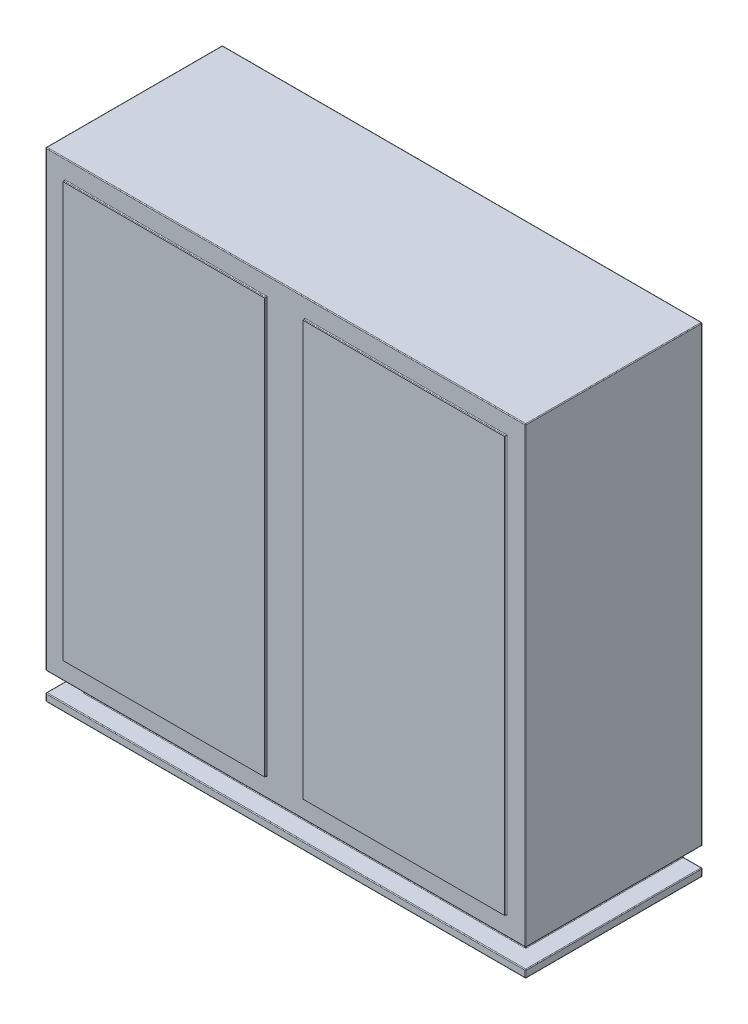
ISO-10303-21;
HEADER;
FILE_DESCRIPTION(('STEP AP214'),'2;1');
FILE_NAME('part.step','',(''),(''),'','','');
FILE_SCHEMA(('AUTOMOTIVE_DESIGN { 1 0 10303 214 1 1 1 1 }'));
ENDSEC;
DATA;
#1=APPLICATION_CONTEXT('core data for automotive mechanical design processes');
#2=APPLICATION_PROTOCOL_DEFINITION('international standard','automotive_design',2000,#1);
#3=PRODUCT_CONTEXT('',#1,'mechanical');
#4=PRODUCT('Part','Part','',(#3));
#5=PRODUCT_RELATED_PRODUCT_CATEGORY('part','',(#4));
#6=PRODUCT_DEFINITION_FORMATION('','',#4);
#7=PRODUCT_DEFINITION_CONTEXT('part definition',#1,'design');
#8=PRODUCT_DEFINITION('design','',#6,#7);
#9=PRODUCT_DEFINITION_SHAPE('','',#8);
#10=(LENGTH_UNIT() NAMED_UNIT(*) SI_UNIT(.MILLI.,.METRE.));
#11=(NAMED_UNIT(*) PLANE_ANGLE_UNIT() SI_UNIT($,.RADIAN.));
#12=(NAMED_UNIT(*) SI_UNIT($,.STERADIAN.) SOLID_ANGLE_UNIT());
#13=UNCERTAINTY_MEASURE_WITH_UNIT(LENGTH_MEASURE(1.E-05),#10,'distance_accuracy_value','');
#14=(GEOMETRIC_REPRESENTATION_CONTEXT(3) GLOBAL_UNCERTAINTY_ASSIGNED_CONTEXT((#13)) GLOBAL_UNIT_ASSIGNED_CONTEXT((#10,
#11,#12)) REPRESENTATION_CONTEXT('',''));
#15=CARTESIAN_POINT('',(0.,0.,0.));
#16=DIRECTION('',(0.,0.,1.));
#17=DIRECTION('',(1.,0.,0.));
#18=AXIS2_PLACEMENT_3D('',#15,#16,#17);
#19=CARTESIAN_POINT('',(625.,70.,230.));
#20=DIRECTION('',(0.,0.,-1.));
#21=DIRECTION('',(-1.,0.,0.));
#22=AXIS2_PLACEMENT_3D('',#19,#20,#21);
#23=PLANE('',#22);
#24=DIRECTION('',(0.,1.,0.));
#25=VECTOR('',#24,1.);
#26=CARTESIAN_POINT('',(577.,120.,230.));
#27=LINE('',#26,#25);
#28=CARTESIAN_POINT('',(577.,1202.,230.));
#29=VERTEX_POINT('',#28);
#30=CARTESIAN_POINT('',(577.,118.,230.));
#31=VERTEX_POINT('',#30);
#32=EDGE_CURVE('E545',#29,#31,#27,.F.);
#33=ORIENTED_EDGE('',*,*,#32,.T.);
#34=DIRECTION('',(1.,0.,0.));
#35=VECTOR('',#34,1.);
#36=CARTESIAN_POINT('',(50.,118.,230.));
#37=LINE('',#36,#35);
#38=CARTESIAN_POINT('',(48.,118.,230.));
#39=VERTEX_POINT('',#38);
#40=EDGE_CURVE('E547',#31,#39,#37,.F.);
#41=ORIENTED_EDGE('',*,*,#40,.T.);
#42=DIRECTION('',(0.,-1.,0.));
#43=VECTOR('',#42,1.);
#44=CARTESIAN_POINT('',(48.,1200.,230.));
#45=LINE('',#44,#43);
#46=CARTESIAN_POINT('',(48.,1202.,230.));
#47=VERTEX_POINT('',#46);
#48=EDGE_CURVE('E541',#39,#47,#45,.F.);
#49=ORIENTED_EDGE('',*,*,#48,.T.);
#50=DIRECTION('',(-1.,0.,0.));
#51=VECTOR('',#50,1.);
#52=CARTESIAN_POINT('',(575.,1202.,230.));
#53=LINE('',#52,#51);
#54=EDGE_CURVE('E543',#47,#29,#53,.F.);
#55=ORIENTED_EDGE('',*,*,#54,.T.);
#56=EDGE_LOOP('',(#33,#41,#49,#55));
#57=FACE_BOUND('',#56,.T.);
#58=DIRECTION('',(0.,1.,0.));
#59=VECTOR('',#58,1.);
#60=CARTESIAN_POINT('',(-48.,120.,230.));
#61=LINE('',#60,#59);
#62=CARTESIAN_POINT('',(-48.,1202.,230.));
#63=VERTEX_POINT('',#62);
#64=CARTESIAN_POINT('',(-48.,118.,230.));
#65=VERTEX_POINT('',#64);
#66=EDGE_CURVE('E536',#63,#65,#61,.F.);
#67=ORIENTED_EDGE('',*,*,#66,.T.);
#68=DIRECTION('',(1.,0.,0.));
#69=VECTOR('',#68,1.);
#70=CARTESIAN_POINT('',(-575.,118.,230.));
#71=LINE('',#70,#69);
#72=CARTESIAN_POINT('',(-577.,118.,230.));
#73=VERTEX_POINT('',#72);
#74=EDGE_CURVE('E538',#65,#73,#71,.F.);
#75=ORIENTED_EDGE('',*,*,#74,.T.);
#76=DIRECTION('',(0.,-1.,0.));
#77=VECTOR('',#76,1.);
#78=CARTESIAN_POINT('',(-577.,1200.,230.));
#79=LINE('',#78,#77);
#80=CARTESIAN_POINT('',(-577.,1202.,230.));
#81=VERTEX_POINT('',#80);
#82=EDGE_CURVE('E532',#73,#81,#79,.F.);
#83=ORIENTED_EDGE('',*,*,#82,.T.);
#84=DIRECTION('',(-1.,0.,0.));
#85=VECTOR('',#84,1.);
#86=CARTESIAN_POINT('',(-50.,1202.,230.));
#87=LINE('',#86,#85);
#88=EDGE_CURVE('E534',#81,#63,#87,.F.);
#89=ORIENTED_EDGE('',*,*,#88,.T.);
#90=EDGE_LOOP('',(#67,#75,#83,#89));
#91=FACE_BOUND('',#90,.T.);
#92=DIRECTION('',(0.,-1.,0.));
#93=VECTOR('',#92,1.);
#94=CARTESIAN_POINT('',(-623.,70.,230.));
#95=LINE('',#94,#93);
#96=CARTESIAN_POINT('',(-623.,1248.,230.));
#97=VERTEX_POINT('',#96);
#98=CARTESIAN_POINT('',(-623.,72.,230.));
#99=VERTEX_POINT('',#98);
#100=EDGE_CURVE('E527',#97,#99,#95,.T.);
#101=ORIENTED_EDGE('',*,*,#100,.T.);
#102=DIRECTION('',(-1.,0.,0.));
#103=VECTOR('',#102,1.);
#104=CARTESIAN_POINT('',(625.,72.,230.));
#105=LINE('',#104,#103);
#106=CARTESIAN_POINT('',(623.,72.,230.));
#107=VERTEX_POINT('',#106);
#108=EDGE_CURVE('E529',#99,#107,#105,.F.);
#109=ORIENTED_EDGE('',*,*,#108,.T.);
#110=DIRECTION('',(0.,-1.,0.));
#111=VECTOR('',#110,1.);
#112=CARTESIAN_POINT('',(623.,70.,230.));
#113=LINE('',#112,#111);
#114=CARTESIAN_POINT('',(623.,1248.,230.));
#115=VERTEX_POINT('',#114);
#116=EDGE_CURVE('E525',#107,#115,#113,.F.);
#117=ORIENTED_EDGE('',*,*,#116,.T.);
#118=DIRECTION('',(-1.,0.,0.));
#119=VECTOR('',#118,1.);
#120=CARTESIAN_POINT('',(625.,1248.,230.));
#121=LINE('',#120,#119);
#122=EDGE_CURVE('E523',#115,#97,#121,.T.);
#123=ORIENTED_EDGE('',*,*,#122,.T.);
#124=EDGE_LOOP('',(#101,#109,#117,#123));
#125=FACE_BOUND('',#124,.T.);
#126=ADVANCED_FACE('F31',(#57,#91,#125),#23,.F.);
#127=CARTESIAN_POINT('',(625.,20.,230.));
#128=DIRECTION('',(-1.,0.,0.));
#129=DIRECTION('',(0.,0.,1.));
#130=AXIS2_PLACEMENT_3D('',#127,#128,#129);
#131=PLANE('',#130);
#132=DIRECTION('',(0.,0.,1.));
#133=VECTOR('',#132,1.);
#134=CARTESIAN_POINT('',(625.,18.,230.));
#135=LINE('',#134,#133);
#136=CARTESIAN_POINT('',(625.,18.,-228.));
#137=VERTEX_POINT('',#136);
#138=CARTESIAN_POINT('',(625.,18.,228.));
#139=VERTEX_POINT('',#138);
#140=EDGE_CURVE('E414',#137,#139,#135,.T.);
#141=ORIENTED_EDGE('',*,*,#140,.T.);
#142=DIRECTION('',(0.,-1.,0.));
#143=VECTOR('',#142,1.);
#144=CARTESIAN_POINT('',(625.,20.,228.));
#145=LINE('',#144,#143);
#146=CARTESIAN_POINT('',(625.,2.,228.));
#147=VERTEX_POINT('',#146);
#148=EDGE_CURVE('E418',#139,#147,#145,.T.);
#149=ORIENTED_EDGE('',*,*,#148,.T.);
#150=DIRECTION('',(0.,0.,-1.));
#151=VECTOR('',#150,1.);
#152=CARTESIAN_POINT('',(625.,2.,230.));
#153=LINE('',#152,#151);
#154=CARTESIAN_POINT('',(625.,2.,-228.));
#155=VERTEX_POINT('',#154);
#156=EDGE_CURVE('E416',#147,#155,#153,.T.);
#157=ORIENTED_EDGE('',*,*,#156,.T.);
#158=DIRECTION('',(0.,1.,0.));
#159=VECTOR('',#158,1.);
#160=CARTESIAN_POINT('',(625.,20.,-228.));
#161=LINE('',#160,#159);
#162=EDGE_CURVE('E412',#155,#137,#161,.T.);
#163=ORIENTED_EDGE('',*,*,#162,.T.);
#164=EDGE_LOOP('',(#141,#149,#157,#163));
#165=FACE_BOUND('',#164,.T.);
#166=ADVANCED_FACE('F894',(#165),#131,.F.);
#167=CARTESIAN_POINT('',(-625.,20.,230.));
#168=DIRECTION('',(-1.,0.,0.));
#169=DIRECTION('',(0.,0.,1.));
#170=AXIS2_PLACEMENT_3D('',#167,#168,#169);
#171=PLANE('',#170);
#172=DIRECTION('',(0.,0.,-1.));
#173=VECTOR('',#172,1.);
#174=CARTESIAN_POINT('',(-625.,72.,230.));
#175=LINE('',#174,#173);
#176=CARTESIAN_POINT('',(-625.,72.,-228.));
#177=VERTEX_POINT('',#176);
#178=CARTESIAN_POINT('',(-625.,72.,228.));
#179=VERTEX_POINT('',#178);
#180=EDGE_CURVE('E604',#177,#179,#175,.F.);
#181=ORIENTED_EDGE('',*,*,#180,.T.);
#182=DIRECTION('',(0.,-1.,0.));
#183=VECTOR('',#182,1.);
#184=CARTESIAN_POINT('',(-625.,1250.,228.));
#185=LINE('',#184,#183);
#186=CARTESIAN_POINT('',(-625.,1248.,228.));
#187=VERTEX_POINT('',#186);
#188=EDGE_CURVE('E606',#179,#187,#185,.F.);
#189=ORIENTED_EDGE('',*,*,#188,.T.);
#190=DIRECTION('',(0.,0.,1.));
#191=VECTOR('',#190,1.);
#192=CARTESIAN_POINT('',(-625.,1248.,-230.));
#193=LINE('',#192,#191);
#194=CARTESIAN_POINT('',(-625.,1248.,-228.));
#195=VERTEX_POINT('',#194);
#196=EDGE_CURVE('E600',#187,#195,#193,.F.);
#197=ORIENTED_EDGE('',*,*,#196,.T.);
#198=DIRECTION('',(0.,1.,0.));
#199=VECTOR('',#198,1.);
#200=CARTESIAN_POINT('',(-625.,70.,-228.));
#201=LINE('',#200,#199);
#202=EDGE_CURVE('E602',#195,#177,#201,.F.);
#203=ORIENTED_EDGE('',*,*,#202,.T.);
#204=EDGE_LOOP('',(#181,#189,#197,#203));
#205=FACE_BOUND('',#204,.T.);
#206=ADVANCED_FACE('F901',(#205),#171,.T.);
#207=CARTESIAN_POINT('',(625.,0.,230.));
#208=DIRECTION('',(0.,0.,-1.));
#209=DIRECTION('',(-1.,0.,0.));
#210=AXIS2_PLACEMENT_3D('',#207,#208,#209);
#211=PLANE('',#210);
#212=DIRECTION('',(0.,-1.,0.));
#213=VECTOR('',#212,1.);
#214=CARTESIAN_POINT('',(-623.,0.,230.));
#215=LINE('',#214,#213);
#216=CARTESIAN_POINT('',(-623.,18.,230.));
#217=VERTEX_POINT('',#216);
#218=CARTESIAN_POINT('',(-623.,2.,230.));
#219=VERTEX_POINT('',#218);
#220=EDGE_CURVE('E423',#217,#219,#215,.T.);
#221=ORIENTED_EDGE('',*,*,#220,.T.);
#222=DIRECTION('',(-1.,0.,0.));
#223=VECTOR('',#222,1.);
#224=CARTESIAN_POINT('',(625.,2.,230.));
#225=LINE('',#224,#223);
#226=CARTESIAN_POINT('',(623.,2.,230.));
#227=VERTEX_POINT('',#226);
#228=EDGE_CURVE('E428',#219,#227,#225,.F.);
#229=ORIENTED_EDGE('',*,*,#228,.T.);
#230=DIRECTION('',(0.,-1.,0.));
#231=VECTOR('',#230,1.);
#232=CARTESIAN_POINT('',(623.,0.,230.));
#233=LINE('',#232,#231);
#234=CARTESIAN_POINT('',(623.,18.,230.));
#235=VERTEX_POINT('',#234);
#236=EDGE_CURVE('E425',#227,#235,#233,.F.);
#237=ORIENTED_EDGE('',*,*,#236,.T.);
#238=DIRECTION('',(-1.,0.,0.));
#239=VECTOR('',#238,1.);
#240=CARTESIAN_POINT('',(625.,18.,230.));
#241=LINE('',#240,#239);
#242=EDGE_CURVE('E421',#235,#217,#241,.T.);
#243=ORIENTED_EDGE('',*,*,#242,.T.);
#244=EDGE_LOOP('',(#221,#229,#237,#243));
#245=FACE_BOUND('',#244,.T.);
#246=ADVANCED_FACE('F919',(#245),#211,.F.);
#247=CARTESIAN_POINT('',(625.,0.,230.));
#248=DIRECTION('',(0.,1.,0.));
#249=DIRECTION('',(0.,0.,1.));
#250=AXIS2_PLACEMENT_3D('',#247,#248,#249);
#251=PLANE('',#250);
#252=DIRECTION('',(0.,0.,-1.));
#253=VECTOR('',#252,1.);
#254=CARTESIAN_POINT('',(623.,0.,230.));
#255=LINE('',#254,#253);
#256=CARTESIAN_POINT('',(623.,0.,-228.));
#257=VERTEX_POINT('',#256);
#258=CARTESIAN_POINT('',(623.,0.,228.));
#259=VERTEX_POINT('',#258);
#260=EDGE_CURVE('E443',#257,#259,#255,.F.);
#261=ORIENTED_EDGE('',*,*,#260,.T.);
#262=DIRECTION('',(-1.,0.,0.));
#263=VECTOR('',#262,1.);
#264=CARTESIAN_POINT('',(625.,0.,228.));
#265=LINE('',#264,#263);
#266=CARTESIAN_POINT('',(-623.,0.,228.));
#267=VERTEX_POINT('',#266);
#268=EDGE_CURVE('E445',#259,#267,#265,.T.);
#269=ORIENTED_EDGE('',*,*,#268,.T.);
#270=DIRECTION('',(0.,0.,-1.));
#271=VECTOR('',#270,1.);
#272=CARTESIAN_POINT('',(-623.,0.,-230.));
#273=LINE('',#272,#271);
#274=CARTESIAN_POINT('',(-623.,0.,-228.));
#275=VERTEX_POINT('',#274);
#276=EDGE_CURVE('E441',#267,#275,#273,.T.);
#277=ORIENTED_EDGE('',*,*,#276,.T.);
#278=DIRECTION('',(-1.,0.,0.));
#279=VECTOR('',#278,1.);
#280=CARTESIAN_POINT('',(625.,0.,-228.));
#281=LINE('',#280,#279);
#282=EDGE_CURVE('E439',#275,#257,#281,.F.);
#283=ORIENTED_EDGE('',*,*,#282,.T.);
#284=EDGE_LOOP('',(#261,#269,#277,#283));
#285=FACE_BOUND('',#284,.T.);
#286=ADVANCED_FACE('F915',(#285),#251,.F.);
#287=CARTESIAN_POINT('',(625.,0.,-230.));
#288=DIRECTION('',(0.,0.,1.));
#289=DIRECTION('',(1.,0.,0.));
#290=AXIS2_PLACEMENT_3D('',#287,#288,#289);
#291=PLANE('',#290);
#292=DIRECTION('',(-1.,0.,0.));
#293=VECTOR('',#292,1.);
#294=CARTESIAN_POINT('',(625.,2.,-230.));
#295=LINE('',#294,#293);
#296=CARTESIAN_POINT('',(623.,2.,-230.));
#297=VERTEX_POINT('',#296);
#298=CARTESIAN_POINT('',(-623.,2.,-230.));
#299=VERTEX_POINT('',#298);
#300=EDGE_CURVE('E596',#297,#299,#295,.T.);
#301=ORIENTED_EDGE('',*,*,#300,.T.);
#302=DIRECTION('',(0.,1.,0.));
#303=VECTOR('',#302,1.);
#304=CARTESIAN_POINT('',(-623.,20.,-230.));
#305=LINE('',#304,#303);
#306=CARTESIAN_POINT('',(-623.,18.,-230.));
#307=VERTEX_POINT('',#306);
#308=EDGE_CURVE('E598',#299,#307,#305,.T.);
#309=ORIENTED_EDGE('',*,*,#308,.T.);
#310=DIRECTION('',(1.,0.,0.));
#311=VECTOR('',#310,1.);
#312=CARTESIAN_POINT('',(625.,18.,-230.));
#313=LINE('',#312,#311);
#314=CARTESIAN_POINT('',(-577.,18.,-230.));
#315=VERTEX_POINT('',#314);
#316=EDGE_CURVE('E587',#307,#315,#313,.T.);
#317=ORIENTED_EDGE('',*,*,#316,.T.);
#318=CARTESIAN_POINT('',(-577.,22.,-230.));
#319=DIRECTION('',(0.,0.,1.));
#320=DIRECTION('',(1.,0.,0.));
#321=AXIS2_PLACEMENT_3D('',#318,#319,#320);
#322=CIRCLE('',#321,4.);
#323=CARTESIAN_POINT('',(-573.,22.,-230.));
#324=VERTEX_POINT('',#323);
#325=EDGE_CURVE('E584',#324,#315,#322,.F.);
#326=ORIENTED_EDGE('',*,*,#325,.F.);
#327=DIRECTION('',(0.,1.,0.));
#328=VECTOR('',#327,1.);
#329=CARTESIAN_POINT('',(-573.,0.,-230.));
#330=LINE('',#329,#328);
#331=CARTESIAN_POINT('',(-573.,68.,-230.));
#332=VERTEX_POINT('',#331);
#333=EDGE_CURVE('E578',#324,#332,#330,.T.);
#334=ORIENTED_EDGE('',*,*,#333,.T.);
#335=CARTESIAN_POINT('',(-577.,68.,-230.));
#336=DIRECTION('',(0.,0.,1.));
#337=DIRECTION('',(1.,0.,0.));
#338=AXIS2_PLACEMENT_3D('',#335,#336,#337);
#339=CIRCLE('',#338,4.);
#340=CARTESIAN_POINT('',(-577.,72.,-230.));
#341=VERTEX_POINT('',#340);
#342=EDGE_CURVE('E575',#341,#332,#339,.F.);
#343=ORIENTED_EDGE('',*,*,#342,.F.);
#344=DIRECTION('',(-1.,0.,0.));
#345=VECTOR('',#344,1.);
#346=CARTESIAN_POINT('',(625.,72.,-230.));
#347=LINE('',#346,#345);
#348=CARTESIAN_POINT('',(-623.,72.,-230.));
#349=VERTEX_POINT('',#348);
#350=EDGE_CURVE('E570',#341,#349,#347,.T.);
#351=ORIENTED_EDGE('',*,*,#350,.T.);
#352=DIRECTION('',(0.,1.,0.));
#353=VECTOR('',#352,1.);
#354=CARTESIAN_POINT('',(-623.,1250.,-230.));
#355=LINE('',#354,#353);
#356=CARTESIAN_POINT('',(-623.,1248.,-230.));
#357=VERTEX_POINT('',#356);
#358=EDGE_CURVE('E568',#349,#357,#355,.T.);
#359=ORIENTED_EDGE('',*,*,#358,.T.);
#360=DIRECTION('',(-1.,0.,0.));
#361=VECTOR('',#360,1.);
#362=CARTESIAN_POINT('',(625.,1248.,-230.));
#363=LINE('',#362,#361);
#364=CARTESIAN_POINT('',(623.,1248.,-230.));
#365=VERTEX_POINT('',#364);
#366=EDGE_CURVE('E564',#357,#365,#363,.F.);
#367=ORIENTED_EDGE('',*,*,#366,.T.);
#368=DIRECTION('',(0.,1.,0.));
#369=VECTOR('',#368,1.);
#370=CARTESIAN_POINT('',(623.,0.,-230.));
#371=LINE('',#370,#369);
#372=CARTESIAN_POINT('',(623.,72.,-230.));
#373=VERTEX_POINT('',#372);
#374=EDGE_CURVE('E566',#365,#373,#371,.F.);
#375=ORIENTED_EDGE('',*,*,#374,.T.);
#376=DIRECTION('',(-1.,0.,0.));
#377=VECTOR('',#376,1.);
#378=CARTESIAN_POINT('',(625.,72.,-230.));
#379=LINE('',#378,#377);
#380=CARTESIAN_POINT('',(577.,72.,-230.));
#381=VERTEX_POINT('',#380);
#382=EDGE_CURVE('E572',#373,#381,#379,.T.);
#383=ORIENTED_EDGE('',*,*,#382,.T.);
#384=CARTESIAN_POINT('',(577.,68.,-230.));
#385=DIRECTION('',(0.,0.,1.));
#386=DIRECTION('',(1.,0.,0.));
#387=AXIS2_PLACEMENT_3D('',#384,#385,#386);
#388=CIRCLE('',#387,4.);
#389=CARTESIAN_POINT('',(573.,68.,-230.));
#390=VERTEX_POINT('',#389);
#391=EDGE_CURVE('E580',#390,#381,#388,.F.);
#392=ORIENTED_EDGE('',*,*,#391,.F.);
#393=DIRECTION('',(0.,-1.,0.));
#394=VECTOR('',#393,1.);
#395=CARTESIAN_POINT('',(573.,0.,-230.));
#396=LINE('',#395,#394);
#397=CARTESIAN_POINT('',(573.,22.,-230.));
#398=VERTEX_POINT('',#397);
#399=EDGE_CURVE('E582',#390,#398,#396,.T.);
#400=ORIENTED_EDGE('',*,*,#399,.T.);
#401=CARTESIAN_POINT('',(577.,22.,-230.));
#402=DIRECTION('',(0.,0.,1.));
#403=DIRECTION('',(1.,0.,0.));
#404=AXIS2_PLACEMENT_3D('',#401,#402,#403);
#405=CIRCLE('',#404,4.);
#406=CARTESIAN_POINT('',(577.,18.,-230.));
#407=VERTEX_POINT('',#406);
#408=EDGE_CURVE('E589',#407,#398,#405,.F.);
#409=ORIENTED_EDGE('',*,*,#408,.F.);
#410=DIRECTION('',(1.,0.,0.));
#411=VECTOR('',#410,1.);
#412=CARTESIAN_POINT('',(625.,18.,-230.));
#413=LINE('',#412,#411);
#414=CARTESIAN_POINT('',(623.,18.,-230.));
#415=VERTEX_POINT('',#414);
#416=EDGE_CURVE('E592',#407,#415,#413,.T.);
#417=ORIENTED_EDGE('',*,*,#416,.T.);
#418=DIRECTION('',(0.,1.,0.));
#419=VECTOR('',#418,1.);
#420=CARTESIAN_POINT('',(623.,0.,-230.));
#421=LINE('',#420,#419);
#422=EDGE_CURVE('E594',#415,#297,#421,.F.);
#423=ORIENTED_EDGE('',*,*,#422,.T.);
#424=EDGE_LOOP('',(#301,#309,#317,#326,#334,#343,#351,#359,#367,#375,#383,#392,#400,#409,#417,#423));
#425=FACE_BOUND('',#424,.T.);
#426=ADVANCED_FACE('F912',(#425),#291,.F.);
#427=CARTESIAN_POINT('',(625.,1250.,-230.));
#428=DIRECTION('',(0.,-1.,0.));
#429=DIRECTION('',(0.,0.,-1.));
#430=AXIS2_PLACEMENT_3D('',#427,#428,#429);
#431=PLANE('',#430);
#432=DIRECTION('',(0.,0.,1.));
#433=VECTOR('',#432,1.);
#434=CARTESIAN_POINT('',(623.,1250.,-230.));
#435=LINE('',#434,#433);
#436=CARTESIAN_POINT('',(623.,1250.,228.));
#437=VERTEX_POINT('',#436);
#438=CARTESIAN_POINT('',(623.,1250.,-228.));
#439=VERTEX_POINT('',#438);
#440=EDGE_CURVE('E40',#437,#439,#435,.F.);
#441=ORIENTED_EDGE('',*,*,#440,.T.);
#442=DIRECTION('',(-1.,0.,0.));
#443=VECTOR('',#442,1.);
#444=CARTESIAN_POINT('',(625.,1250.,-228.));
#445=LINE('',#444,#443);
#446=CARTESIAN_POINT('',(-623.,1250.,-228.));
#447=VERTEX_POINT('',#446);
#448=EDGE_CURVE('E11',#439,#447,#445,.T.);
#449=ORIENTED_EDGE('',*,*,#448,.T.);
#450=DIRECTION('',(0.,0.,1.));
#451=VECTOR('',#450,1.);
#452=CARTESIAN_POINT('',(-623.,1250.,230.));
#453=LINE('',#452,#451);
#454=CARTESIAN_POINT('',(-623.,1250.,228.));
#455=VERTEX_POINT('',#454);
#456=EDGE_CURVE('E618',#447,#455,#453,.T.);
#457=ORIENTED_EDGE('',*,*,#456,.T.);
#458=DIRECTION('',(-1.,0.,0.));
#459=VECTOR('',#458,1.);
#460=CARTESIAN_POINT('',(625.,1250.,228.));
#461=LINE('',#460,#459);
#462=EDGE_CURVE('E51',#455,#437,#461,.F.);
#463=ORIENTED_EDGE('',*,*,#462,.T.);
#464=EDGE_LOOP('',(#441,#449,#457,#463));
#465=FACE_BOUND('',#464,.T.);
#466=ADVANCED_FACE('F909',(#465),#431,.F.);
#467=CARTESIAN_POINT('',(625.,70.,180.));
#468=DIRECTION('',(0.,1.,0.));
#469=DIRECTION('',(0.,0.,1.));
#470=AXIS2_PLACEMENT_3D('',#467,#468,#469);
#471=PLANE('',#470);
#472=DIRECTION('',(-1.,0.,0.));
#473=VECTOR('',#472,1.);
#474=CARTESIAN_POINT('',(625.,70.,-228.));
#475=LINE('',#474,#473);
#476=CARTESIAN_POINT('',(-623.,70.,-228.));
#477=VERTEX_POINT('',#476);
#478=CARTESIAN_POINT('',(-577.,70.,-228.));
#479=VERTEX_POINT('',#478);
#480=EDGE_CURVE('E508',#477,#479,#475,.F.);
#481=ORIENTED_EDGE('',*,*,#480,.T.);
#482=DIRECTION('',(0.,0.,1.));
#483=VECTOR('',#482,1.);
#484=CARTESIAN_POINT('',(-577.,70.,180.));
#485=LINE('',#484,#483);
#486=CARTESIAN_POINT('',(-577.,70.,178.));
#487=VERTEX_POINT('',#486);
#488=EDGE_CURVE('E518',#479,#487,#485,.T.);
#489=ORIENTED_EDGE('',*,*,#488,.T.);
#490=CARTESIAN_POINT('',(-573.,70.,178.));
#491=DIRECTION('',(0.,1.,0.));
#492=DIRECTION('',(0.,0.,1.));
#493=AXIS2_PLACEMENT_3D('',#490,#491,#492);
#494=CIRCLE('',#493,4.);
#495=CARTESIAN_POINT('',(-573.,70.,182.));
#496=VERTEX_POINT('',#495);
#497=EDGE_CURVE('E515',#496,#487,#494,.F.);
#498=ORIENTED_EDGE('',*,*,#497,.F.);
#499=DIRECTION('',(-1.,0.,0.));
#500=VECTOR('',#499,1.);
#501=CARTESIAN_POINT('',(575.,70.,182.));
#502=LINE('',#501,#500);
#503=CARTESIAN_POINT('',(573.,70.,182.));
#504=VERTEX_POINT('',#503);
#505=EDGE_CURVE('E513',#496,#504,#502,.F.);
#506=ORIENTED_EDGE('',*,*,#505,.T.);
#507=CARTESIAN_POINT('',(573.,70.,178.));
#508=DIRECTION('',(0.,1.,0.));
#509=DIRECTION('',(0.,0.,1.));
#510=AXIS2_PLACEMENT_3D('',#507,#508,#509);
#511=CIRCLE('',#510,4.);
#512=CARTESIAN_POINT('',(577.,70.,178.));
#513=VERTEX_POINT('',#512);
#514=EDGE_CURVE('E510',#513,#504,#511,.F.);
#515=ORIENTED_EDGE('',*,*,#514,.F.);
#516=DIRECTION('',(0.,0.,1.));
#517=VECTOR('',#516,1.);
#518=CARTESIAN_POINT('',(577.,70.,-230.));
#519=LINE('',#518,#517);
#520=CARTESIAN_POINT('',(577.,70.,-228.));
#521=VERTEX_POINT('',#520);
#522=EDGE_CURVE('E504',#513,#521,#519,.F.);
#523=ORIENTED_EDGE('',*,*,#522,.T.);
#524=DIRECTION('',(-1.,0.,0.));
#525=VECTOR('',#524,1.);
#526=CARTESIAN_POINT('',(625.,70.,-228.));
#527=LINE('',#526,#525);
#528=CARTESIAN_POINT('',(623.,70.,-228.));
#529=VERTEX_POINT('',#528);
#530=EDGE_CURVE('E500',#521,#529,#527,.F.);
#531=ORIENTED_EDGE('',*,*,#530,.T.);
#532=DIRECTION('',(0.,0.,-1.));
#533=VECTOR('',#532,1.);
#534=CARTESIAN_POINT('',(623.,70.,180.));
#535=LINE('',#534,#533);
#536=CARTESIAN_POINT('',(623.,70.,228.));
#537=VERTEX_POINT('',#536);
#538=EDGE_CURVE('E498',#529,#537,#535,.F.);
#539=ORIENTED_EDGE('',*,*,#538,.T.);
#540=DIRECTION('',(-1.,0.,0.));
#541=VECTOR('',#540,1.);
#542=CARTESIAN_POINT('',(625.,70.,228.));
#543=LINE('',#542,#541);
#544=CARTESIAN_POINT('',(-623.,70.,228.));
#545=VERTEX_POINT('',#544);
#546=EDGE_CURVE('E502',#537,#545,#543,.T.);
#547=ORIENTED_EDGE('',*,*,#546,.T.);
#548=DIRECTION('',(0.,0.,-1.));
#549=VECTOR('',#548,1.);
#550=CARTESIAN_POINT('',(-623.,70.,-230.));
#551=LINE('',#550,#549);
#552=EDGE_CURVE('E506',#545,#477,#551,.T.);
#553=ORIENTED_EDGE('',*,*,#552,.T.);
#554=EDGE_LOOP('',(#481,#489,#498,#506,#515,#523,#531,#539,#547,#553));
#555=FACE_BOUND('',#554,.T.);
#556=ADVANCED_FACE('F907',(#555),#471,.F.);
#557=CARTESIAN_POINT('',(625.,20.,180.));
#558=DIRECTION('',(0.,0.,-1.));
#559=DIRECTION('',(-1.,0.,0.));
#560=AXIS2_PLACEMENT_3D('',#557,#558,#559);
#561=PLANE('',#560);
#562=DIRECTION('',(0.,-1.,0.));
#563=VECTOR('',#562,1.);
#564=CARTESIAN_POINT('',(-573.,20.,180.));
#565=LINE('',#564,#563);
#566=CARTESIAN_POINT('',(-573.,68.,180.));
#567=VERTEX_POINT('',#566);
#568=CARTESIAN_POINT('',(-573.,22.,180.));
#569=VERTEX_POINT('',#568);
#570=EDGE_CURVE('E452',#567,#569,#565,.T.);
#571=ORIENTED_EDGE('',*,*,#570,.T.);
#572=DIRECTION('',(-1.,0.,0.));
#573=VECTOR('',#572,1.);
#574=CARTESIAN_POINT('',(575.,22.,180.));
#575=LINE('',#574,#573);
#576=CARTESIAN_POINT('',(573.,22.,180.));
#577=VERTEX_POINT('',#576);
#578=EDGE_CURVE('E455',#569,#577,#575,.F.);
#579=ORIENTED_EDGE('',*,*,#578,.T.);
#580=DIRECTION('',(0.,1.,0.));
#581=VECTOR('',#580,1.);
#582=CARTESIAN_POINT('',(573.,20.,180.));
#583=LINE('',#582,#581);
#584=CARTESIAN_POINT('',(573.,68.,180.));
#585=VERTEX_POINT('',#584);
#586=EDGE_CURVE('E450',#577,#585,#583,.T.);
#587=ORIENTED_EDGE('',*,*,#586,.T.);
#588=DIRECTION('',(-1.,0.,0.));
#589=VECTOR('',#588,1.);
#590=CARTESIAN_POINT('',(-575.,68.,180.));
#591=LINE('',#590,#589);
#592=EDGE_CURVE('E448',#585,#567,#591,.T.);
#593=ORIENTED_EDGE('',*,*,#592,.T.);
#594=EDGE_LOOP('',(#571,#579,#587,#593));
#595=FACE_BOUND('',#594,.T.);
#596=ADVANCED_FACE('F1564',(#595),#561,.F.);
#597=CARTESIAN_POINT('',(625.,20.,230.));
#598=DIRECTION('',(0.,-1.,0.));
#599=DIRECTION('',(0.,0.,-1.));
#600=AXIS2_PLACEMENT_3D('',#597,#598,#599);
#601=PLANE('',#600);
#602=DIRECTION('',(0.,0.,1.));
#603=VECTOR('',#602,1.);
#604=CARTESIAN_POINT('',(-577.,20.,-230.));
#605=LINE('',#604,#603);
#606=CARTESIAN_POINT('',(-577.,20.,178.));
#607=VERTEX_POINT('',#606);
#608=CARTESIAN_POINT('',(-577.,20.,-228.));
#609=VERTEX_POINT('',#608);
#610=EDGE_CURVE('E493',#607,#609,#605,.F.);
#611=ORIENTED_EDGE('',*,*,#610,.T.);
#612=DIRECTION('',(1.,0.,0.));
#613=VECTOR('',#612,1.);
#614=CARTESIAN_POINT('',(625.,20.,-228.));
#615=LINE('',#614,#613);
#616=CARTESIAN_POINT('',(-623.,20.,-228.));
#617=VERTEX_POINT('',#616);
#618=EDGE_CURVE('E496',#609,#617,#615,.F.);
#619=ORIENTED_EDGE('',*,*,#618,.T.);
#620=DIRECTION('',(0.,0.,1.));
#621=VECTOR('',#620,1.);
#622=CARTESIAN_POINT('',(-623.,20.,230.));
#623=LINE('',#622,#621);
#624=CARTESIAN_POINT('',(-623.,20.,228.));
#625=VERTEX_POINT('',#624);
#626=EDGE_CURVE('E488',#617,#625,#623,.T.);
#627=ORIENTED_EDGE('',*,*,#626,.T.);
#628=DIRECTION('',(-1.,0.,0.));
#629=VECTOR('',#628,1.);
#630=CARTESIAN_POINT('',(625.,20.,228.));
#631=LINE('',#630,#629);
#632=CARTESIAN_POINT('',(623.,20.,228.));
#633=VERTEX_POINT('',#632);
#634=EDGE_CURVE('E481',#625,#633,#631,.F.);
#635=ORIENTED_EDGE('',*,*,#634,.T.);
#636=DIRECTION('',(0.,0.,1.));
#637=VECTOR('',#636,1.);
#638=CARTESIAN_POINT('',(623.,20.,230.));
#639=LINE('',#638,#637);
#640=CARTESIAN_POINT('',(623.,20.,-228.));
#641=VERTEX_POINT('',#640);
#642=EDGE_CURVE('E477',#633,#641,#639,.F.);
#643=ORIENTED_EDGE('',*,*,#642,.T.);
#644=DIRECTION('',(1.,0.,0.));
#645=VECTOR('',#644,1.);
#646=CARTESIAN_POINT('',(625.,20.,-228.));
#647=LINE('',#646,#645);
#648=CARTESIAN_POINT('',(577.,20.,-228.));
#649=VERTEX_POINT('',#648);
#650=EDGE_CURVE('E475',#641,#649,#647,.F.);
#651=ORIENTED_EDGE('',*,*,#650,.T.);
#652=DIRECTION('',(0.,0.,1.));
#653=VECTOR('',#652,1.);
#654=CARTESIAN_POINT('',(577.,20.,180.));
#655=LINE('',#654,#653);
#656=CARTESIAN_POINT('',(577.,20.,178.));
#657=VERTEX_POINT('',#656);
#658=EDGE_CURVE('E479',#649,#657,#655,.T.);
#659=ORIENTED_EDGE('',*,*,#658,.T.);
#660=CARTESIAN_POINT('',(573.,20.,178.));
#661=DIRECTION('',(0.,-1.,0.));
#662=DIRECTION('',(0.,0.,-1.));
#663=AXIS2_PLACEMENT_3D('',#660,#661,#662);
#664=CIRCLE('',#663,4.);
#665=CARTESIAN_POINT('',(573.,20.,182.));
#666=VERTEX_POINT('',#665);
#667=EDGE_CURVE('E483',#666,#657,#664,.F.);
#668=ORIENTED_EDGE('',*,*,#667,.F.);
#669=DIRECTION('',(-1.,0.,0.));
#670=VECTOR('',#669,1.);
#671=CARTESIAN_POINT('',(-575.,20.,182.));
#672=LINE('',#671,#670);
#673=CARTESIAN_POINT('',(-573.,20.,182.));
#674=VERTEX_POINT('',#673);
#675=EDGE_CURVE('E486',#666,#674,#672,.T.);
#676=ORIENTED_EDGE('',*,*,#675,.T.);
#677=CARTESIAN_POINT('',(-573.,20.,178.));
#678=DIRECTION('',(0.,-1.,0.));
#679=DIRECTION('',(0.,0.,-1.));
#680=AXIS2_PLACEMENT_3D('',#677,#678,#679);
#681=CIRCLE('',#680,4.);
#682=EDGE_CURVE('E490',#607,#674,#681,.F.);
#683=ORIENTED_EDGE('',*,*,#682,.F.);
#684=EDGE_LOOP('',(#611,#619,#627,#635,#643,#651,#659,#668,#676,#683));
#685=FACE_BOUND('',#684,.T.);
#686=ADVANCED_FACE('F1555',(#685),#601,.F.);
#687=DIRECTION('',(0.,-1.,0.));
#688=VECTOR('',#687,1.);
#689=CARTESIAN_POINT('',(625.,20.,228.));
#690=LINE('',#689,#688);
#691=CARTESIAN_POINT('',(625.,1248.,228.));
#692=VERTEX_POINT('',#691);
#693=CARTESIAN_POINT('',(625.,72.,228.));
#694=VERTEX_POINT('',#693);
#695=EDGE_CURVE('E613',#692,#694,#690,.T.);
#696=ORIENTED_EDGE('',*,*,#695,.T.);
#697=DIRECTION('',(0.,0.,-1.));
#698=VECTOR('',#697,1.);
#699=CARTESIAN_POINT('',(625.,72.,230.));
#700=LINE('',#699,#698);
#701=CARTESIAN_POINT('',(625.,72.,-228.));
#702=VERTEX_POINT('',#701);
#703=EDGE_CURVE('E616',#694,#702,#700,.T.);
#704=ORIENTED_EDGE('',*,*,#703,.T.);
#705=DIRECTION('',(0.,1.,0.));
#706=VECTOR('',#705,1.);
#707=CARTESIAN_POINT('',(625.,20.,-228.));
#708=LINE('',#707,#706);
#709=CARTESIAN_POINT('',(625.,1248.,-228.));
#710=VERTEX_POINT('',#709);
#711=EDGE_CURVE('E611',#702,#710,#708,.T.);
#712=ORIENTED_EDGE('',*,*,#711,.T.);
#713=DIRECTION('',(0.,0.,1.));
#714=VECTOR('',#713,1.);
#715=CARTESIAN_POINT('',(625.,1248.,230.));
#716=LINE('',#715,#714);
#717=EDGE_CURVE('E609',#710,#692,#716,.T.);
#718=ORIENTED_EDGE('',*,*,#717,.T.);
#719=EDGE_LOOP('',(#696,#704,#712,#718));
#720=FACE_BOUND('',#719,.T.);
#721=ADVANCED_FACE('F904',(#720),#131,.F.);
#722=DIRECTION('',(0.,0.,-1.));
#723=VECTOR('',#722,1.);
#724=CARTESIAN_POINT('',(-625.,2.,230.));
#725=LINE('',#724,#723);
#726=CARTESIAN_POINT('',(-625.,2.,-228.));
#727=VERTEX_POINT('',#726);
#728=CARTESIAN_POINT('',(-625.,2.,228.));
#729=VERTEX_POINT('',#728);
#730=EDGE_CURVE('E434',#727,#729,#725,.F.);
#731=ORIENTED_EDGE('',*,*,#730,.T.);
#732=DIRECTION('',(0.,-1.,0.));
#733=VECTOR('',#732,1.);
#734=CARTESIAN_POINT('',(-625.,20.,228.));
#735=LINE('',#734,#733);
#736=CARTESIAN_POINT('',(-625.,18.,228.));
#737=VERTEX_POINT('',#736);
#738=EDGE_CURVE('E436',#729,#737,#735,.F.);
#739=ORIENTED_EDGE('',*,*,#738,.T.);
#740=DIRECTION('',(0.,0.,1.));
#741=VECTOR('',#740,1.);
#742=CARTESIAN_POINT('',(-625.,18.,-230.));
#743=LINE('',#742,#741);
#744=CARTESIAN_POINT('',(-625.,18.,-228.));
#745=VERTEX_POINT('',#744);
#746=EDGE_CURVE('E432',#737,#745,#743,.F.);
#747=ORIENTED_EDGE('',*,*,#746,.T.);
#748=DIRECTION('',(0.,1.,0.));
#749=VECTOR('',#748,1.);
#750=CARTESIAN_POINT('',(-625.,0.,-228.));
#751=LINE('',#750,#749);
#752=EDGE_CURVE('E430',#745,#727,#751,.F.);
#753=ORIENTED_EDGE('',*,*,#752,.T.);
#754=EDGE_LOOP('',(#731,#739,#747,#753));
#755=FACE_BOUND('',#754,.T.);
#756=ADVANCED_FACE('F1534',(#755),#171,.T.);
#757=CARTESIAN_POINT('',(-575.,70.,-230.));
#758=DIRECTION('',(1.,0.,0.));
#759=DIRECTION('',(0.,0.,-1.));
#760=AXIS2_PLACEMENT_3D('',#757,#758,#759);
#761=PLANE('',#760);
#762=DIRECTION('',(0.,0.,1.));
#763=VECTOR('',#762,1.);
#764=CARTESIAN_POINT('',(-575.,22.,180.));
#765=LINE('',#764,#763);
#766=CARTESIAN_POINT('',(-575.,22.,-228.));
#767=VERTEX_POINT('',#766);
#768=CARTESIAN_POINT('',(-575.,22.,178.));
#769=VERTEX_POINT('',#768);
#770=EDGE_CURVE('E461',#767,#769,#765,.T.);
#771=ORIENTED_EDGE('',*,*,#770,.T.);
#772=DIRECTION('',(0.,-1.,0.));
#773=VECTOR('',#772,1.);
#774=CARTESIAN_POINT('',(-575.,70.,178.));
#775=LINE('',#774,#773);
#776=CARTESIAN_POINT('',(-575.,68.,178.));
#777=VERTEX_POINT('',#776);
#778=EDGE_CURVE('E463',#769,#777,#775,.F.);
#779=ORIENTED_EDGE('',*,*,#778,.T.);
#780=DIRECTION('',(0.,0.,1.));
#781=VECTOR('',#780,1.);
#782=CARTESIAN_POINT('',(-575.,68.,-230.));
#783=LINE('',#782,#781);
#784=CARTESIAN_POINT('',(-575.,68.,-228.));
#785=VERTEX_POINT('',#784);
#786=EDGE_CURVE('E459',#777,#785,#783,.F.);
#787=ORIENTED_EDGE('',*,*,#786,.T.);
#788=DIRECTION('',(0.,1.,0.));
#789=VECTOR('',#788,1.);
#790=CARTESIAN_POINT('',(-575.,70.,-228.));
#791=LINE('',#790,#789);
#792=EDGE_CURVE('E457',#785,#767,#791,.F.);
#793=ORIENTED_EDGE('',*,*,#792,.T.);
#794=EDGE_LOOP('',(#771,#779,#787,#793));
#795=FACE_BOUND('',#794,.T.);
#796=ADVANCED_FACE('F1524',(#795),#761,.F.);
#797=CARTESIAN_POINT('',(575.,20.,-230.));
#798=DIRECTION('',(-1.,0.,0.));
#799=DIRECTION('',(0.,0.,1.));
#800=AXIS2_PLACEMENT_3D('',#797,#798,#799);
#801=PLANE('',#800);
#802=DIRECTION('',(0.,0.,1.));
#803=VECTOR('',#802,1.);
#804=CARTESIAN_POINT('',(575.,68.,180.));
#805=LINE('',#804,#803);
#806=CARTESIAN_POINT('',(575.,68.,-228.));
#807=VERTEX_POINT('',#806);
#808=CARTESIAN_POINT('',(575.,68.,178.));
#809=VERTEX_POINT('',#808);
#810=EDGE_CURVE('E468',#807,#809,#805,.T.);
#811=ORIENTED_EDGE('',*,*,#810,.T.);
#812=DIRECTION('',(0.,1.,0.));
#813=VECTOR('',#812,1.);
#814=CARTESIAN_POINT('',(575.,20.,178.));
#815=LINE('',#814,#813);
#816=CARTESIAN_POINT('',(575.,22.,178.));
#817=VERTEX_POINT('',#816);
#818=EDGE_CURVE('E472',#809,#817,#815,.F.);
#819=ORIENTED_EDGE('',*,*,#818,.T.);
#820=DIRECTION('',(0.,0.,1.));
#821=VECTOR('',#820,1.);
#822=CARTESIAN_POINT('',(575.,22.,-230.));
#823=LINE('',#822,#821);
#824=CARTESIAN_POINT('',(575.,22.,-228.));
#825=VERTEX_POINT('',#824);
#826=EDGE_CURVE('E470',#817,#825,#823,.F.);
#827=ORIENTED_EDGE('',*,*,#826,.T.);
#828=DIRECTION('',(0.,-1.,0.));
#829=VECTOR('',#828,1.);
#830=CARTESIAN_POINT('',(575.,20.,-228.));
#831=LINE('',#830,#829);
#832=EDGE_CURVE('E466',#825,#807,#831,.F.);
#833=ORIENTED_EDGE('',*,*,#832,.T.);
#834=EDGE_LOOP('',(#811,#819,#827,#833));
#835=FACE_BOUND('',#834,.T.);
#836=ADVANCED_FACE('F1514',(#835),#801,.F.);
#837=CARTESIAN_POINT('',(-575.,1200.,235.));
#838=DIRECTION('',(1.,0.,0.));
#839=DIRECTION('',(0.,0.,-1.));
#840=AXIS2_PLACEMENT_3D('',#837,#838,#839);
#841=PLANE('',#840);
#842=DIRECTION('',(0.,0.,-1.));
#843=VECTOR('',#842,1.);
#844=CARTESIAN_POINT('',(-575.,1200.,235.));
#845=LINE('',#844,#843);
#846=CARTESIAN_POINT('',(-575.,1200.,235.));
#847=VERTEX_POINT('',#846);
#848=CARTESIAN_POINT('',(-575.,1200.,232.));
#849=VERTEX_POINT('',#848);
#850=EDGE_CURVE('E400',#847,#849,#845,.T.);
#851=ORIENTED_EDGE('',*,*,#850,.T.);
#852=DIRECTION('',(0.,-1.,0.));
#853=VECTOR('',#852,1.);
#854=CARTESIAN_POINT('',(-575.,120.,232.));
#855=LINE('',#854,#853);
#856=CARTESIAN_POINT('',(-575.,120.,232.));
#857=VERTEX_POINT('',#856);
#858=EDGE_CURVE('E562',#849,#857,#855,.T.);
#859=ORIENTED_EDGE('',*,*,#858,.T.);
#860=DIRECTION('',(0.,0.,-1.));
#861=VECTOR('',#860,1.);
#862=CARTESIAN_POINT('',(-575.,120.,235.));
#863=LINE('',#862,#861);
#864=CARTESIAN_POINT('',(-575.,120.,235.));
#865=VERTEX_POINT('',#864);
#866=EDGE_CURVE('E409',#865,#857,#863,.T.);
#867=ORIENTED_EDGE('',*,*,#866,.F.);
#868=DIRECTION('',(0.,-1.,0.));
#869=VECTOR('',#868,1.);
#870=CARTESIAN_POINT('',(-575.,1200.,235.));
#871=LINE('',#870,#869);
#872=EDGE_CURVE('E386',#847,#865,#871,.T.);
#873=ORIENTED_EDGE('',*,*,#872,.F.);
#874=EDGE_LOOP('',(#851,#859,#867,#873));
#875=FACE_BOUND('',#874,.T.);
#876=ADVANCED_FACE('F881',(#875),#841,.F.);
#877=CARTESIAN_POINT('',(-575.,120.,235.));
#878=DIRECTION('',(0.,1.,0.));
#879=DIRECTION('',(0.,0.,1.));
#880=AXIS2_PLACEMENT_3D('',#877,#878,#879);
#881=PLANE('',#880);
#882=ORIENTED_EDGE('',*,*,#866,.T.);
#883=DIRECTION('',(1.,0.,0.));
#884=VECTOR('',#883,1.);
#885=CARTESIAN_POINT('',(-50.,120.,232.));
#886=LINE('',#885,#884);
#887=CARTESIAN_POINT('',(-50.,120.,232.));
#888=VERTEX_POINT('',#887);
#889=EDGE_CURVE('E555',#857,#888,#886,.T.);
#890=ORIENTED_EDGE('',*,*,#889,.T.);
#891=DIRECTION('',(0.,0.,-1.));
#892=VECTOR('',#891,1.);
#893=CARTESIAN_POINT('',(-50.,120.,235.));
#894=LINE('',#893,#892);
#895=CARTESIAN_POINT('',(-50.,120.,235.));
#896=VERTEX_POINT('',#895);
#897=EDGE_CURVE('E406',#896,#888,#894,.T.);
#898=ORIENTED_EDGE('',*,*,#897,.F.);
#899=DIRECTION('',(1.,0.,0.));
#900=VECTOR('',#899,1.);
#901=CARTESIAN_POINT('',(-575.,120.,235.));
#902=LINE('',#901,#900);
#903=EDGE_CURVE('E389',#865,#896,#902,.T.);
#904=ORIENTED_EDGE('',*,*,#903,.F.);
#905=EDGE_LOOP('',(#882,#890,#898,#904));
#906=FACE_BOUND('',#905,.T.);
#907=ADVANCED_FACE('F871',(#906),#881,.F.);
#908=CARTESIAN_POINT('',(-50.,1200.,235.));
#909=DIRECTION('',(-1.,0.,0.));
#910=DIRECTION('',(0.,-1.,0.));
#911=AXIS2_PLACEMENT_3D('',#908,#909,#910);
#912=PLANE('',#911);
#913=ORIENTED_EDGE('',*,*,#897,.T.);
#914=DIRECTION('',(0.,1.,0.));
#915=VECTOR('',#914,1.);
#916=CARTESIAN_POINT('',(-50.,1200.,232.));
#917=LINE('',#916,#915);
#918=CARTESIAN_POINT('',(-50.,1200.,232.));
#919=VERTEX_POINT('',#918);
#920=EDGE_CURVE('E558',#888,#919,#917,.T.);
#921=ORIENTED_EDGE('',*,*,#920,.T.);
#922=DIRECTION('',(0.,0.,-1.));
#923=VECTOR('',#922,1.);
#924=CARTESIAN_POINT('',(-50.,1200.,235.));
#925=LINE('',#924,#923);
#926=CARTESIAN_POINT('',(-50.,1200.,235.));
#927=VERTEX_POINT('',#926);
#928=EDGE_CURVE('E403',#927,#919,#925,.T.);
#929=ORIENTED_EDGE('',*,*,#928,.F.);
#930=DIRECTION('',(0.,1.,0.));
#931=VECTOR('',#930,1.);
#932=CARTESIAN_POINT('',(-50.,1200.,235.));
#933=LINE('',#932,#931);
#934=EDGE_CURVE('E396',#896,#927,#933,.T.);
#935=ORIENTED_EDGE('',*,*,#934,.F.);
#936=EDGE_LOOP('',(#913,#921,#929,#935));
#937=FACE_BOUND('',#936,.T.);
#938=ADVANCED_FACE('F874',(#937),#912,.F.);
#939=CARTESIAN_POINT('',(-575.,1200.,235.));
#940=DIRECTION('',(0.,-1.,0.));
#941=DIRECTION('',(0.,0.,-1.));
#942=AXIS2_PLACEMENT_3D('',#939,#940,#941);
#943=PLANE('',#942);
#944=ORIENTED_EDGE('',*,*,#928,.T.);
#945=DIRECTION('',(-1.,0.,0.));
#946=VECTOR('',#945,1.);
#947=CARTESIAN_POINT('',(-575.,1200.,232.));
#948=LINE('',#947,#946);
#949=EDGE_CURVE('E560',#919,#849,#948,.T.);
#950=ORIENTED_EDGE('',*,*,#949,.T.);
#951=ORIENTED_EDGE('',*,*,#850,.F.);
#952=DIRECTION('',(-1.,0.,0.));
#953=VECTOR('',#952,1.);
#954=CARTESIAN_POINT('',(-575.,1200.,235.));
#955=LINE('',#954,#953);
#956=EDGE_CURVE('E398',#927,#847,#955,.T.);
#957=ORIENTED_EDGE('',*,*,#956,.F.);
#958=EDGE_LOOP('',(#944,#950,#951,#957));
#959=FACE_BOUND('',#958,.T.);
#960=ADVANCED_FACE('F883',(#959),#943,.F.);
#961=CARTESIAN_POINT('',(-575.,120.,235.));
#962=DIRECTION('',(0.,0.,1.));
#963=DIRECTION('',(1.,0.,0.));
#964=AXIS2_PLACEMENT_3D('',#961,#962,#963);
#965=PLANE('',#964);
#966=ORIENTED_EDGE('',*,*,#872,.T.);
#967=ORIENTED_EDGE('',*,*,#903,.T.);
#968=ORIENTED_EDGE('',*,*,#934,.T.);
#969=ORIENTED_EDGE('',*,*,#956,.T.);
#970=EDGE_LOOP('',(#966,#967,#968,#969));
#971=FACE_BOUND('',#970,.T.);
#972=ADVANCED_FACE('F877',(#971),#965,.T.);
#973=CARTESIAN_POINT('',(50.,1200.,235.));
#974=DIRECTION('',(1.,0.,0.));
#975=DIRECTION('',(0.,1.,0.));
#976=AXIS2_PLACEMENT_3D('',#973,#974,#975);
#977=PLANE('',#976);
#978=DIRECTION('',(0.,0.,-1.));
#979=VECTOR('',#978,1.);
#980=CARTESIAN_POINT('',(50.,1200.,235.));
#981=LINE('',#980,#979);
#982=CARTESIAN_POINT('',(50.,1200.,235.));
#983=VERTEX_POINT('',#982);
#984=CARTESIAN_POINT('',(50.,1200.,232.));
#985=VERTEX_POINT('',#984);
#986=EDGE_CURVE('E1776',#983,#985,#981,.T.);
#987=ORIENTED_EDGE('',*,*,#986,.T.);
#988=DIRECTION('',(0.,-1.,0.));
#989=VECTOR('',#988,1.);
#990=CARTESIAN_POINT('',(50.,120.,232.));
#991=LINE('',#990,#989);
#992=CARTESIAN_POINT('',(50.,120.,232.));
#993=VERTEX_POINT('',#992);
#994=EDGE_CURVE('E385',#985,#993,#991,.T.);
#995=ORIENTED_EDGE('',*,*,#994,.T.);
#996=DIRECTION('',(0.,0.,-1.));
#997=VECTOR('',#996,1.);
#998=CARTESIAN_POINT('',(50.,120.,235.));
#999=LINE('',#998,#997);
#1000=CARTESIAN_POINT('',(50.,120.,235.));
#1001=VERTEX_POINT('',#1000);
#1002=EDGE_CURVE('E365',#1001,#993,#999,.T.);
#1003=ORIENTED_EDGE('',*,*,#1002,.F.);
#1004=DIRECTION('',(0.,-1.,0.));
#1005=VECTOR('',#1004,1.);
#1006=CARTESIAN_POINT('',(50.,1200.,235.));
#1007=LINE('',#1006,#1005);
#1008=EDGE_CURVE('E372',#983,#1001,#1007,.T.);
#1009=ORIENTED_EDGE('',*,*,#1008,.F.);
#1010=EDGE_LOOP('',(#987,#995,#1003,#1009));
#1011=FACE_BOUND('',#1010,.T.);
#1012=ADVANCED_FACE('F383',(#1011),#977,.F.);
#1013=CARTESIAN_POINT('',(50.,120.,235.));
#1014=DIRECTION('',(0.,1.,0.));
#1015=DIRECTION('',(0.,0.,1.));
#1016=AXIS2_PLACEMENT_3D('',#1013,#1014,#1015);
#1017=PLANE('',#1016);
#1018=ORIENTED_EDGE('',*,*,#1002,.T.);
#1019=DIRECTION('',(1.,0.,0.));
#1020=VECTOR('',#1019,1.);
#1021=CARTESIAN_POINT('',(575.,120.,232.));
#1022=LINE('',#1021,#1020);
#1023=CARTESIAN_POINT('',(575.,120.,232.));
#1024=VERTEX_POINT('',#1023);
#1025=EDGE_CURVE('E521',#993,#1024,#1022,.T.);
#1026=ORIENTED_EDGE('',*,*,#1025,.T.);
#1027=DIRECTION('',(0.,0.,-1.));
#1028=VECTOR('',#1027,1.);
#1029=CARTESIAN_POINT('',(575.,120.,235.));
#1030=LINE('',#1029,#1028);
#1031=CARTESIAN_POINT('',(575.,120.,235.));
#1032=VERTEX_POINT('',#1031);
#1033=EDGE_CURVE('E368',#1032,#1024,#1030,.T.);
#1034=ORIENTED_EDGE('',*,*,#1033,.F.);
#1035=DIRECTION('',(1.,0.,0.));
#1036=VECTOR('',#1035,1.);
#1037=CARTESIAN_POINT('',(50.,120.,235.));
#1038=LINE('',#1037,#1036);
#1039=EDGE_CURVE('E360',#1001,#1032,#1038,.T.);
#1040=ORIENTED_EDGE('',*,*,#1039,.F.);
#1041=EDGE_LOOP('',(#1018,#1026,#1034,#1040));
#1042=FACE_BOUND('',#1041,.T.);
#1043=ADVANCED_FACE('F362',(#1042),#1017,.F.);
#1044=CARTESIAN_POINT('',(575.,1200.,235.));
#1045=DIRECTION('',(-1.,0.,0.));
#1046=DIRECTION('',(0.,0.,1.));
#1047=AXIS2_PLACEMENT_3D('',#1044,#1045,#1046);
#1048=PLANE('',#1047);
#1049=ORIENTED_EDGE('',*,*,#1033,.T.);
#1050=DIRECTION('',(0.,1.,0.));
#1051=VECTOR('',#1050,1.);
#1052=CARTESIAN_POINT('',(575.,1200.,232.));
#1053=LINE('',#1052,#1051);
#1054=CARTESIAN_POINT('',(575.,1200.,232.));
#1055=VERTEX_POINT('',#1054);
#1056=EDGE_CURVE('E550',#1024,#1055,#1053,.T.);
#1057=ORIENTED_EDGE('',*,*,#1056,.T.);
#1058=DIRECTION('',(0.,0.,-1.));
#1059=VECTOR('',#1058,1.);
#1060=CARTESIAN_POINT('',(575.,1200.,235.));
#1061=LINE('',#1060,#1059);
#1062=CARTESIAN_POINT('',(575.,1200.,235.));
#1063=VERTEX_POINT('',#1062);
#1064=EDGE_CURVE('E391',#1063,#1055,#1061,.T.);
#1065=ORIENTED_EDGE('',*,*,#1064,.F.);
#1066=DIRECTION('',(0.,1.,0.));
#1067=VECTOR('',#1066,1.);
#1068=CARTESIAN_POINT('',(575.,1200.,235.));
#1069=LINE('',#1068,#1067);
#1070=EDGE_CURVE('E371',#1032,#1063,#1069,.T.);
#1071=ORIENTED_EDGE('',*,*,#1070,.F.);
#1072=EDGE_LOOP('',(#1049,#1057,#1065,#1071));
#1073=FACE_BOUND('',#1072,.T.);
#1074=ADVANCED_FACE('F1459',(#1073),#1048,.F.);
#1075=CARTESIAN_POINT('',(50.,1200.,235.));
#1076=DIRECTION('',(0.,-1.,0.));
#1077=DIRECTION('',(0.,0.,-1.));
#1078=AXIS2_PLACEMENT_3D('',#1075,#1076,#1077);
#1079=PLANE('',#1078);
#1080=ORIENTED_EDGE('',*,*,#1064,.T.);
#1081=DIRECTION('',(-1.,0.,0.));
#1082=VECTOR('',#1081,1.);
#1083=CARTESIAN_POINT('',(50.,1200.,232.));
#1084=LINE('',#1083,#1082);
#1085=EDGE_CURVE('E552',#1055,#985,#1084,.T.);
#1086=ORIENTED_EDGE('',*,*,#1085,.T.);
#1087=ORIENTED_EDGE('',*,*,#986,.F.);
#1088=DIRECTION('',(-1.,0.,0.));
#1089=VECTOR('',#1088,1.);
#1090=CARTESIAN_POINT('',(50.,1200.,235.));
#1091=LINE('',#1090,#1089);
#1092=EDGE_CURVE('E377',#1063,#983,#1091,.T.);
#1093=ORIENTED_EDGE('',*,*,#1092,.F.);
#1094=EDGE_LOOP('',(#1080,#1086,#1087,#1093));
#1095=FACE_BOUND('',#1094,.T.);
#1096=ADVANCED_FACE('F1451',(#1095),#1079,.F.);
#1097=CARTESIAN_POINT('',(50.,120.,235.));
#1098=DIRECTION('',(0.,0.,1.));
#1099=DIRECTION('',(1.,0.,0.));
#1100=AXIS2_PLACEMENT_3D('',#1097,#1098,#1099);
#1101=PLANE('',#1100);
#1102=ORIENTED_EDGE('',*,*,#1008,.T.);
#1103=ORIENTED_EDGE('',*,*,#1039,.T.);
#1104=ORIENTED_EDGE('',*,*,#1070,.T.);
#1105=ORIENTED_EDGE('',*,*,#1092,.T.);
#1106=EDGE_LOOP('',(#1102,#1103,#1104,#1105));
#1107=FACE_BOUND('',#1106,.T.);
#1108=ADVANCED_FACE('F375',(#1107),#1101,.T.);
#1109=CARTESIAN_POINT('',(-623.,1248.,228.));
#1110=DIRECTION('',(0.,0.,1.));
#1111=DIRECTION('',(1.,0.,0.));
#1112=AXIS2_PLACEMENT_3D('',#1109,#1110,#1111);
#1113=SPHERICAL_SURFACE('',#1112,2.);
#1114=CARTESIAN_POINT('',(-623.,1248.,228.));
#1115=DIRECTION('',(0.,0.,1.));
#1116=DIRECTION('',(1.,0.,0.));
#1117=AXIS2_PLACEMENT_3D('',#1114,#1115,#1116);
#1118=CIRCLE('',#1117,2.);
#1119=EDGE_CURVE('E823',#187,#455,#1118,.F.);
#1120=ORIENTED_EDGE('',*,*,#1119,.F.);
#1121=CARTESIAN_POINT('',(-623.,1248.,228.));
#1122=DIRECTION('',(0.,1.,0.));
#1123=DIRECTION('',(0.,0.,1.));
#1124=AXIS2_PLACEMENT_3D('',#1121,#1122,#1123);
#1125=CIRCLE('',#1124,2.);
#1126=EDGE_CURVE('E381',#97,#187,#1125,.F.);
#1127=ORIENTED_EDGE('',*,*,#1126,.F.);
#1128=CARTESIAN_POINT('',(-623.,1248.,228.));
#1129=DIRECTION('',(-1.,0.,0.));
#1130=DIRECTION('',(0.,0.,1.));
#1131=AXIS2_PLACEMENT_3D('',#1128,#1129,#1130);
#1132=CIRCLE('',#1131,2.);
#1133=EDGE_CURVE('E826',#455,#97,#1132,.F.);
#1134=ORIENTED_EDGE('',*,*,#1133,.F.);
#1135=EDGE_LOOP('',(#1120,#1127,#1134));
#1136=FACE_BOUND('',#1135,.T.);
#1137=ADVANCED_FACE('F1160',(#1136),#1113,.T.);
#1138=CARTESIAN_POINT('',(-623.,70.,228.));
#1139=DIRECTION('',(0.,1.,0.));
#1140=DIRECTION('',(0.,0.,1.));
#1141=AXIS2_PLACEMENT_3D('',#1138,#1139,#1140);
#1142=CYLINDRICAL_SURFACE('',#1141,2.);
#1143=ORIENTED_EDGE('',*,*,#1126,.T.);
#1144=ORIENTED_EDGE('',*,*,#188,.F.);
#1145=CARTESIAN_POINT('',(-623.,72.,228.));
#1146=DIRECTION('',(0.,-1.,0.));
#1147=DIRECTION('',(0.,0.,-1.));
#1148=AXIS2_PLACEMENT_3D('',#1145,#1146,#1147);
#1149=CIRCLE('',#1148,2.);
#1150=EDGE_CURVE('E820',#99,#179,#1149,.T.);
#1151=ORIENTED_EDGE('',*,*,#1150,.F.);
#1152=ORIENTED_EDGE('',*,*,#100,.F.);
#1153=EDGE_LOOP('',(#1143,#1144,#1151,#1152));
#1154=FACE_BOUND('',#1153,.T.);
#1155=ADVANCED_FACE('F1156',(#1154),#1142,.T.);
#1156=CARTESIAN_POINT('',(625.,1248.,228.));
#1157=DIRECTION('',(-1.,0.,0.));
#1158=DIRECTION('',(0.,0.,1.));
#1159=AXIS2_PLACEMENT_3D('',#1156,#1157,#1158);
#1160=CYLINDRICAL_SURFACE('',#1159,2.);
#1161=ORIENTED_EDGE('',*,*,#1133,.T.);
#1162=ORIENTED_EDGE('',*,*,#122,.F.);
#1163=CARTESIAN_POINT('',(623.,1248.,228.));
#1164=DIRECTION('',(1.,0.,0.));
#1165=DIRECTION('',(0.,0.,-1.));
#1166=AXIS2_PLACEMENT_3D('',#1163,#1164,#1165);
#1167=CIRCLE('',#1166,2.);
#1168=EDGE_CURVE('E817',#437,#115,#1167,.T.);
#1169=ORIENTED_EDGE('',*,*,#1168,.F.);
#1170=ORIENTED_EDGE('',*,*,#462,.F.);
#1171=EDGE_LOOP('',(#1161,#1162,#1169,#1170));
#1172=FACE_BOUND('',#1171,.T.);
#1173=ADVANCED_FACE('F1152',(#1172),#1160,.T.);
#1174=CARTESIAN_POINT('',(-623.,1248.,-230.));
#1175=DIRECTION('',(0.,0.,-1.));
#1176=DIRECTION('',(-1.,0.,0.));
#1177=AXIS2_PLACEMENT_3D('',#1174,#1175,#1176);
#1178=CYLINDRICAL_SURFACE('',#1177,2.);
#1179=ORIENTED_EDGE('',*,*,#1119,.T.);
#1180=ORIENTED_EDGE('',*,*,#456,.F.);
#1181=CARTESIAN_POINT('',(-623.,1248.,-228.));
#1182=DIRECTION('',(0.,0.,-1.));
#1183=DIRECTION('',(-1.,0.,0.));
#1184=AXIS2_PLACEMENT_3D('',#1181,#1182,#1183);
#1185=CIRCLE('',#1184,2.);
#1186=EDGE_CURVE('E814',#195,#447,#1185,.T.);
#1187=ORIENTED_EDGE('',*,*,#1186,.F.);
#1188=ORIENTED_EDGE('',*,*,#196,.F.);
#1189=EDGE_LOOP('',(#1179,#1180,#1187,#1188));
#1190=FACE_BOUND('',#1189,.T.);
#1191=ADVANCED_FACE('F1148',(#1190),#1178,.T.);
#1192=CARTESIAN_POINT('',(-623.,72.,228.));
#1193=DIRECTION('',(0.,0.,1.));
#1194=DIRECTION('',(1.,0.,0.));
#1195=AXIS2_PLACEMENT_3D('',#1192,#1193,#1194);
#1196=SPHERICAL_SURFACE('',#1195,2.);
#1197=CARTESIAN_POINT('',(-623.,72.,228.));
#1198=DIRECTION('',(-1.,0.,0.));
#1199=DIRECTION('',(0.,0.,1.));
#1200=AXIS2_PLACEMENT_3D('',#1197,#1198,#1199);
#1201=CIRCLE('',#1200,2.);
#1202=EDGE_CURVE('E805',#99,#545,#1201,.F.);
#1203=ORIENTED_EDGE('',*,*,#1202,.F.);
#1204=ORIENTED_EDGE('',*,*,#1150,.T.);
#1205=CARTESIAN_POINT('',(-623.,72.,228.));
#1206=DIRECTION('',(0.,0.,1.));
#1207=DIRECTION('',(1.,0.,0.));
#1208=AXIS2_PLACEMENT_3D('',#1205,#1206,#1207);
#1209=CIRCLE('',#1208,2.);
#1210=EDGE_CURVE('E808',#545,#179,#1209,.F.);
#1211=ORIENTED_EDGE('',*,*,#1210,.F.);
#1212=EDGE_LOOP('',(#1203,#1204,#1211));
#1213=FACE_BOUND('',#1212,.T.);
#1214=ADVANCED_FACE('F1144',(#1213),#1196,.T.);
#1215=CARTESIAN_POINT('',(623.,1248.,228.));
#1216=DIRECTION('',(0.,0.,1.));
#1217=DIRECTION('',(1.,0.,0.));
#1218=AXIS2_PLACEMENT_3D('',#1215,#1216,#1217);
#1219=SPHERICAL_SURFACE('',#1218,2.);
#1220=CARTESIAN_POINT('',(623.,1248.,228.));
#1221=DIRECTION('',(0.,0.,1.));
#1222=DIRECTION('',(1.,0.,0.));
#1223=AXIS2_PLACEMENT_3D('',#1220,#1221,#1222);
#1224=CIRCLE('',#1223,2.);
#1225=EDGE_CURVE('E799',#437,#692,#1224,.F.);
#1226=ORIENTED_EDGE('',*,*,#1225,.F.);
#1227=ORIENTED_EDGE('',*,*,#1168,.T.);
#1228=CARTESIAN_POINT('',(623.,1248.,228.));
#1229=DIRECTION('',(0.,1.,0.));
#1230=DIRECTION('',(0.,0.,1.));
#1231=AXIS2_PLACEMENT_3D('',#1228,#1229,#1230);
#1232=CIRCLE('',#1231,2.);
#1233=EDGE_CURVE('E802',#692,#115,#1232,.F.);
#1234=ORIENTED_EDGE('',*,*,#1233,.F.);
#1235=EDGE_LOOP('',(#1226,#1227,#1234));
#1236=FACE_BOUND('',#1235,.T.);
#1237=ADVANCED_FACE('F1140',(#1236),#1219,.T.);
#1238=CARTESIAN_POINT('',(-623.,1248.,-228.));
#1239=DIRECTION('',(0.,0.,1.));
#1240=DIRECTION('',(1.,0.,0.));
#1241=AXIS2_PLACEMENT_3D('',#1238,#1239,#1240);
#1242=SPHERICAL_SURFACE('',#1241,2.);
#1243=CARTESIAN_POINT('',(-623.,1248.,-228.));
#1244=DIRECTION('',(-1.,0.,0.));
#1245=DIRECTION('',(0.,0.,1.));
#1246=AXIS2_PLACEMENT_3D('',#1243,#1244,#1245);
#1247=CIRCLE('',#1246,2.);
#1248=EDGE_CURVE('E797',#357,#447,#1247,.F.);
#1249=ORIENTED_EDGE('',*,*,#1248,.F.);
#1250=CARTESIAN_POINT('',(-623.,1248.,-228.));
#1251=DIRECTION('',(0.,1.,0.));
#1252=DIRECTION('',(0.,0.,1.));
#1253=AXIS2_PLACEMENT_3D('',#1250,#1251,#1252);
#1254=CIRCLE('',#1253,2.);
#1255=EDGE_CURVE('E811',#195,#357,#1254,.F.);
#1256=ORIENTED_EDGE('',*,*,#1255,.F.);
#1257=ORIENTED_EDGE('',*,*,#1186,.T.);
#1258=EDGE_LOOP('',(#1249,#1256,#1257));
#1259=FACE_BOUND('',#1258,.T.);
#1260=ADVANCED_FACE('F1136',(#1259),#1242,.T.);
#1261=CARTESIAN_POINT('',(-623.,0.,-228.));
#1262=DIRECTION('',(0.,-1.,0.));
#1263=DIRECTION('',(0.,0.,-1.));
#1264=AXIS2_PLACEMENT_3D('',#1261,#1262,#1263);
#1265=CYLINDRICAL_SURFACE('',#1264,2.);
#1266=ORIENTED_EDGE('',*,*,#1255,.T.);
#1267=ORIENTED_EDGE('',*,*,#358,.F.);
#1268=CARTESIAN_POINT('',(-623.,72.,-228.));
#1269=DIRECTION('',(0.,-1.,0.));
#1270=DIRECTION('',(0.,0.,-1.));
#1271=AXIS2_PLACEMENT_3D('',#1268,#1269,#1270);
#1272=CIRCLE('',#1271,2.);
#1273=EDGE_CURVE('E794',#177,#349,#1272,.T.);
#1274=ORIENTED_EDGE('',*,*,#1273,.F.);
#1275=ORIENTED_EDGE('',*,*,#202,.F.);
#1276=EDGE_LOOP('',(#1266,#1267,#1274,#1275));
#1277=FACE_BOUND('',#1276,.T.);
#1278=ADVANCED_FACE('F1132',(#1277),#1265,.T.);
#1279=CARTESIAN_POINT('',(-623.,72.,180.));
#1280=DIRECTION('',(0.,0.,1.));
#1281=DIRECTION('',(1.,0.,0.));
#1282=AXIS2_PLACEMENT_3D('',#1279,#1280,#1281);
#1283=CYLINDRICAL_SURFACE('',#1282,2.);
#1284=ORIENTED_EDGE('',*,*,#1210,.T.);
#1285=ORIENTED_EDGE('',*,*,#180,.F.);
#1286=CARTESIAN_POINT('',(-623.,72.,-228.));
#1287=DIRECTION('',(0.,0.,-1.));
#1288=DIRECTION('',(-1.,0.,0.));
#1289=AXIS2_PLACEMENT_3D('',#1286,#1287,#1288);
#1290=CIRCLE('',#1289,2.);
#1291=EDGE_CURVE('E791',#477,#177,#1290,.T.);
#1292=ORIENTED_EDGE('',*,*,#1291,.F.);
#1293=ORIENTED_EDGE('',*,*,#552,.F.);
#1294=EDGE_LOOP('',(#1284,#1285,#1292,#1293));
#1295=FACE_BOUND('',#1294,.T.);
#1296=ADVANCED_FACE('F1128',(#1295),#1283,.T.);
#1297=CARTESIAN_POINT('',(625.,72.,228.));
#1298=DIRECTION('',(-1.,0.,0.));
#1299=DIRECTION('',(0.,0.,1.));
#1300=AXIS2_PLACEMENT_3D('',#1297,#1298,#1299);
#1301=CYLINDRICAL_SURFACE('',#1300,2.);
#1302=ORIENTED_EDGE('',*,*,#1202,.T.);
#1303=ORIENTED_EDGE('',*,*,#546,.F.);
#1304=CARTESIAN_POINT('',(623.,72.,228.));
#1305=DIRECTION('',(1.,0.,0.));
#1306=DIRECTION('',(0.,0.,-1.));
#1307=AXIS2_PLACEMENT_3D('',#1304,#1305,#1306);
#1308=CIRCLE('',#1307,2.);
#1309=EDGE_CURVE('E788',#107,#537,#1308,.T.);
#1310=ORIENTED_EDGE('',*,*,#1309,.F.);
#1311=ORIENTED_EDGE('',*,*,#108,.F.);
#1312=EDGE_LOOP('',(#1302,#1303,#1310,#1311));
#1313=FACE_BOUND('',#1312,.T.);
#1314=ADVANCED_FACE('F1124',(#1313),#1301,.T.);
#1315=CARTESIAN_POINT('',(623.,20.,228.));
#1316=DIRECTION('',(0.,-1.,0.));
#1317=DIRECTION('',(0.,0.,-1.));
#1318=AXIS2_PLACEMENT_3D('',#1315,#1316,#1317);
#1319=CYLINDRICAL_SURFACE('',#1318,2.);
#1320=ORIENTED_EDGE('',*,*,#1233,.T.);
#1321=ORIENTED_EDGE('',*,*,#116,.F.);
#1322=CARTESIAN_POINT('',(623.,72.,228.));
#1323=DIRECTION('',(0.,-1.,0.));
#1324=DIRECTION('',(0.,0.,-1.));
#1325=AXIS2_PLACEMENT_3D('',#1322,#1323,#1324);
#1326=CIRCLE('',#1325,2.);
#1327=EDGE_CURVE('E786',#694,#107,#1326,.T.);
#1328=ORIENTED_EDGE('',*,*,#1327,.F.);
#1329=ORIENTED_EDGE('',*,*,#695,.F.);
#1330=EDGE_LOOP('',(#1320,#1321,#1328,#1329));
#1331=FACE_BOUND('',#1330,.T.);
#1332=ADVANCED_FACE('F1120',(#1331),#1319,.T.);
#1333=CARTESIAN_POINT('',(623.,1248.,230.));
#1334=DIRECTION('',(0.,0.,1.));
#1335=DIRECTION('',(1.,0.,0.));
#1336=AXIS2_PLACEMENT_3D('',#1333,#1334,#1335);
#1337=CYLINDRICAL_SURFACE('',#1336,2.);
#1338=ORIENTED_EDGE('',*,*,#1225,.T.);
#1339=ORIENTED_EDGE('',*,*,#717,.F.);
#1340=CARTESIAN_POINT('',(623.,1248.,-228.));
#1341=DIRECTION('',(0.,0.,-1.));
#1342=DIRECTION('',(-1.,0.,0.));
#1343=AXIS2_PLACEMENT_3D('',#1340,#1341,#1342);
#1344=CIRCLE('',#1343,2.);
#1345=EDGE_CURVE('E783',#439,#710,#1344,.T.);
#1346=ORIENTED_EDGE('',*,*,#1345,.F.);
#1347=ORIENTED_EDGE('',*,*,#440,.F.);
#1348=EDGE_LOOP('',(#1338,#1339,#1346,#1347));
#1349=FACE_BOUND('',#1348,.T.);
#1350=ADVANCED_FACE('F1116',(#1349),#1337,.T.);
#1351=CARTESIAN_POINT('',(625.,1248.,-228.));
#1352=DIRECTION('',(-1.,0.,0.));
#1353=DIRECTION('',(0.,0.,1.));
#1354=AXIS2_PLACEMENT_3D('',#1351,#1352,#1353);
#1355=CYLINDRICAL_SURFACE('',#1354,2.);
#1356=ORIENTED_EDGE('',*,*,#1248,.T.);
#1357=ORIENTED_EDGE('',*,*,#448,.F.);
#1358=CARTESIAN_POINT('',(623.,1248.,-228.));
#1359=DIRECTION('',(1.,0.,0.));
#1360=DIRECTION('',(0.,0.,-1.));
#1361=AXIS2_PLACEMENT_3D('',#1358,#1359,#1360);
#1362=CIRCLE('',#1361,2.);
#1363=EDGE_CURVE('E780',#365,#439,#1362,.T.);
#1364=ORIENTED_EDGE('',*,*,#1363,.F.);
#1365=ORIENTED_EDGE('',*,*,#366,.F.);
#1366=EDGE_LOOP('',(#1356,#1357,#1364,#1365));
#1367=FACE_BOUND('',#1366,.T.);
#1368=ADVANCED_FACE('F1112',(#1367),#1355,.T.);
#1369=CARTESIAN_POINT('',(-623.,72.,-228.));
#1370=DIRECTION('',(0.,0.,1.));
#1371=DIRECTION('',(1.,0.,0.));
#1372=AXIS2_PLACEMENT_3D('',#1369,#1370,#1371);
#1373=SPHERICAL_SURFACE('',#1372,2.);
#1374=ORIENTED_EDGE('',*,*,#1291,.T.);
#1375=ORIENTED_EDGE('',*,*,#1273,.T.);
#1376=CARTESIAN_POINT('',(-623.,72.,-228.));
#1377=DIRECTION('',(-1.,0.,0.));
#1378=DIRECTION('',(0.,0.,1.));
#1379=AXIS2_PLACEMENT_3D('',#1376,#1377,#1378);
#1380=CIRCLE('',#1379,2.);
#1381=EDGE_CURVE('E777',#477,#349,#1380,.F.);
#1382=ORIENTED_EDGE('',*,*,#1381,.F.);
#1383=EDGE_LOOP('',(#1374,#1375,#1382));
#1384=FACE_BOUND('',#1383,.T.);
#1385=ADVANCED_FACE('F1108',(#1384),#1373,.T.);
#1386=CARTESIAN_POINT('',(-573.,68.,178.));
#1387=DIRECTION('',(0.,1.,0.));
#1388=DIRECTION('',(0.,0.,1.));
#1389=AXIS2_PLACEMENT_3D('',#1386,#1387,#1388);
#1390=TOROIDAL_SURFACE('',#1389,4.,2.);
#1391=CARTESIAN_POINT('',(-573.,68.,182.));
#1392=DIRECTION('',(1.,0.,0.));
#1393=DIRECTION('',(0.,0.,-1.));
#1394=AXIS2_PLACEMENT_3D('',#1391,#1392,#1393);
#1395=CIRCLE('',#1394,2.);
#1396=EDGE_CURVE('E769',#496,#567,#1395,.F.);
#1397=ORIENTED_EDGE('',*,*,#1396,.F.);
#1398=ORIENTED_EDGE('',*,*,#497,.T.);
#1399=CARTESIAN_POINT('',(-577.,68.,178.));
#1400=DIRECTION('',(0.,0.,-1.));
#1401=DIRECTION('',(-1.,0.,0.));
#1402=AXIS2_PLACEMENT_3D('',#1399,#1400,#1401);
#1403=CIRCLE('',#1402,2.);
#1404=EDGE_CURVE('E775',#777,#487,#1403,.F.);
#1405=ORIENTED_EDGE('',*,*,#1404,.F.);
#1406=CARTESIAN_POINT('',(-573.,68.,178.));
#1407=DIRECTION('',(0.,1.,0.));
#1408=DIRECTION('',(0.,0.,1.));
#1409=AXIS2_PLACEMENT_3D('',#1406,#1407,#1408);
#1410=CIRCLE('',#1409,2.);
#1411=EDGE_CURVE('E772',#567,#777,#1410,.F.);
#1412=ORIENTED_EDGE('',*,*,#1411,.F.);
#1413=EDGE_LOOP('',(#1397,#1398,#1405,#1412));
#1414=FACE_BOUND('',#1413,.T.);
#1415=ADVANCED_FACE('F1104',(#1414),#1390,.F.);
#1416=CARTESIAN_POINT('',(623.,72.,228.));
#1417=DIRECTION('',(0.,0.,1.));
#1418=DIRECTION('',(1.,0.,0.));
#1419=AXIS2_PLACEMENT_3D('',#1416,#1417,#1418);
#1420=SPHERICAL_SURFACE('',#1419,2.);
#1421=ORIENTED_EDGE('',*,*,#1327,.T.);
#1422=ORIENTED_EDGE('',*,*,#1309,.T.);
#1423=CARTESIAN_POINT('',(623.,72.,228.));
#1424=DIRECTION('',(0.,0.,1.));
#1425=DIRECTION('',(1.,0.,0.));
#1426=AXIS2_PLACEMENT_3D('',#1423,#1424,#1425);
#1427=CIRCLE('',#1426,2.);
#1428=EDGE_CURVE('E766',#694,#537,#1427,.F.);
#1429=ORIENTED_EDGE('',*,*,#1428,.F.);
#1430=EDGE_LOOP('',(#1421,#1422,#1429));
#1431=FACE_BOUND('',#1430,.T.);
#1432=ADVANCED_FACE('F1100',(#1431),#1420,.T.);
#1433=CARTESIAN_POINT('',(623.,1248.,-228.));
#1434=DIRECTION('',(0.,0.,1.));
#1435=DIRECTION('',(1.,0.,0.));
#1436=AXIS2_PLACEMENT_3D('',#1433,#1434,#1435);
#1437=SPHERICAL_SURFACE('',#1436,2.);
#1438=ORIENTED_EDGE('',*,*,#1363,.T.);
#1439=ORIENTED_EDGE('',*,*,#1345,.T.);
#1440=CARTESIAN_POINT('',(623.,1248.,-228.));
#1441=DIRECTION('',(0.,1.,0.));
#1442=DIRECTION('',(0.,0.,1.));
#1443=AXIS2_PLACEMENT_3D('',#1440,#1441,#1442);
#1444=CIRCLE('',#1443,2.);
#1445=EDGE_CURVE('E763',#365,#710,#1444,.F.);
#1446=ORIENTED_EDGE('',*,*,#1445,.F.);
#1447=EDGE_LOOP('',(#1438,#1439,#1446));
#1448=FACE_BOUND('',#1447,.T.);
#1449=ADVANCED_FACE('F1096',(#1448),#1437,.T.);
#1450=CARTESIAN_POINT('',(625.,72.,-228.));
#1451=DIRECTION('',(-1.,0.,0.));
#1452=DIRECTION('',(0.,0.,1.));
#1453=AXIS2_PLACEMENT_3D('',#1450,#1451,#1452);
#1454=CYLINDRICAL_SURFACE('',#1453,2.);
#1455=ORIENTED_EDGE('',*,*,#1381,.T.);
#1456=ORIENTED_EDGE('',*,*,#350,.F.);
#1457=CARTESIAN_POINT('',(-577.,72.,-228.));
#1458=DIRECTION('',(1.,0.,0.));
#1459=DIRECTION('',(0.,0.,-1.));
#1460=AXIS2_PLACEMENT_3D('',#1457,#1458,#1459);
#1461=CIRCLE('',#1460,2.);
#1462=EDGE_CURVE('E760',#479,#341,#1461,.T.);
#1463=ORIENTED_EDGE('',*,*,#1462,.F.);
#1464=ORIENTED_EDGE('',*,*,#480,.F.);
#1465=EDGE_LOOP('',(#1455,#1456,#1463,#1464));
#1466=FACE_BOUND('',#1465,.T.);
#1467=ADVANCED_FACE('F1092',(#1466),#1454,.T.);
#1468=CARTESIAN_POINT('',(-577.,68.,180.));
#1469=DIRECTION('',(0.,0.,-1.));
#1470=DIRECTION('',(-1.,0.,0.));
#1471=AXIS2_PLACEMENT_3D('',#1468,#1469,#1470);
#1472=CYLINDRICAL_SURFACE('',#1471,2.);
#1473=ORIENTED_EDGE('',*,*,#1404,.T.);
#1474=ORIENTED_EDGE('',*,*,#488,.F.);
#1475=CARTESIAN_POINT('',(-577.,68.,-228.));
#1476=DIRECTION('',(0.,0.,1.));
#1477=DIRECTION('',(1.,0.,0.));
#1478=AXIS2_PLACEMENT_3D('',#1475,#1476,#1477);
#1479=CIRCLE('',#1478,2.);
#1480=EDGE_CURVE('E757',#785,#479,#1479,.T.);
#1481=ORIENTED_EDGE('',*,*,#1480,.F.);
#1482=ORIENTED_EDGE('',*,*,#786,.F.);
#1483=EDGE_LOOP('',(#1473,#1474,#1481,#1482));
#1484=FACE_BOUND('',#1483,.T.);
#1485=ADVANCED_FACE('F1088',(#1484),#1472,.F.);
#1486=CARTESIAN_POINT('',(-573.,20.,178.));
#1487=DIRECTION('',(0.,-1.,0.));
#1488=DIRECTION('',(0.,0.,-1.));
#1489=AXIS2_PLACEMENT_3D('',#1486,#1487,#1488);
#1490=CYLINDRICAL_SURFACE('',#1489,2.);
#1491=ORIENTED_EDGE('',*,*,#1411,.T.);
#1492=ORIENTED_EDGE('',*,*,#778,.F.);
#1493=CARTESIAN_POINT('',(-573.,22.,178.));
#1494=DIRECTION('',(0.,-1.,0.));
#1495=DIRECTION('',(0.,0.,-1.));
#1496=AXIS2_PLACEMENT_3D('',#1493,#1494,#1495);
#1497=CIRCLE('',#1496,2.);
#1498=EDGE_CURVE('E754',#569,#769,#1497,.T.);
#1499=ORIENTED_EDGE('',*,*,#1498,.F.);
#1500=ORIENTED_EDGE('',*,*,#570,.F.);
#1501=EDGE_LOOP('',(#1491,#1492,#1499,#1500));
#1502=FACE_BOUND('',#1501,.T.);
#1503=ADVANCED_FACE('F1084',(#1502),#1490,.T.);
#1504=CARTESIAN_POINT('',(625.,68.,182.));
#1505=DIRECTION('',(1.,0.,0.));
#1506=DIRECTION('',(0.,0.,-1.));
#1507=AXIS2_PLACEMENT_3D('',#1504,#1505,#1506);
#1508=CYLINDRICAL_SURFACE('',#1507,2.);
#1509=ORIENTED_EDGE('',*,*,#1396,.T.);
#1510=ORIENTED_EDGE('',*,*,#592,.F.);
#1511=CARTESIAN_POINT('',(573.,68.,182.));
#1512=DIRECTION('',(-1.,0.,0.));
#1513=DIRECTION('',(0.,0.,1.));
#1514=AXIS2_PLACEMENT_3D('',#1511,#1512,#1513);
#1515=CIRCLE('',#1514,2.);
#1516=EDGE_CURVE('E751',#504,#585,#1515,.T.);
#1517=ORIENTED_EDGE('',*,*,#1516,.F.);
#1518=ORIENTED_EDGE('',*,*,#505,.F.);
#1519=EDGE_LOOP('',(#1509,#1510,#1517,#1518));
#1520=FACE_BOUND('',#1519,.T.);
#1521=ADVANCED_FACE('F1080',(#1520),#1508,.F.);
#1522=CARTESIAN_POINT('',(623.,72.,230.));
#1523=DIRECTION('',(0.,0.,-1.));
#1524=DIRECTION('',(-1.,0.,0.));
#1525=AXIS2_PLACEMENT_3D('',#1522,#1523,#1524);
#1526=CYLINDRICAL_SURFACE('',#1525,2.);
#1527=ORIENTED_EDGE('',*,*,#1428,.T.);
#1528=ORIENTED_EDGE('',*,*,#538,.F.);
#1529=CARTESIAN_POINT('',(623.,72.,-228.));
#1530=DIRECTION('',(0.,0.,-1.));
#1531=DIRECTION('',(-1.,0.,0.));
#1532=AXIS2_PLACEMENT_3D('',#1529,#1530,#1531);
#1533=CIRCLE('',#1532,2.);
#1534=EDGE_CURVE('E748',#702,#529,#1533,.T.);
#1535=ORIENTED_EDGE('',*,*,#1534,.F.);
#1536=ORIENTED_EDGE('',*,*,#703,.F.);
#1537=EDGE_LOOP('',(#1527,#1528,#1535,#1536));
#1538=FACE_BOUND('',#1537,.T.);
#1539=ADVANCED_FACE('F1076',(#1538),#1526,.T.);
#1540=CARTESIAN_POINT('',(623.,20.,-228.));
#1541=DIRECTION('',(0.,1.,0.));
#1542=DIRECTION('',(0.,0.,1.));
#1543=AXIS2_PLACEMENT_3D('',#1540,#1541,#1542);
#1544=CYLINDRICAL_SURFACE('',#1543,2.);
#1545=ORIENTED_EDGE('',*,*,#1445,.T.);
#1546=ORIENTED_EDGE('',*,*,#711,.F.);
#1547=CARTESIAN_POINT('',(623.,72.,-228.));
#1548=DIRECTION('',(0.,-1.,0.));
#1549=DIRECTION('',(0.,0.,-1.));
#1550=AXIS2_PLACEMENT_3D('',#1547,#1548,#1549);
#1551=CIRCLE('',#1550,2.);
#1552=EDGE_CURVE('E745',#373,#702,#1551,.T.);
#1553=ORIENTED_EDGE('',*,*,#1552,.F.);
#1554=ORIENTED_EDGE('',*,*,#374,.F.);
#1555=EDGE_LOOP('',(#1545,#1546,#1553,#1554));
#1556=FACE_BOUND('',#1555,.T.);
#1557=ADVANCED_FACE('F1072',(#1556),#1544,.T.);
#1558=CARTESIAN_POINT('',(-577.,68.,-228.));
#1559=DIRECTION('',(0.,0.,1.));
#1560=DIRECTION('',(1.,0.,0.));
#1561=AXIS2_PLACEMENT_3D('',#1558,#1559,#1560);
#1562=TOROIDAL_SURFACE('',#1561,4.,2.);
#1563=ORIENTED_EDGE('',*,*,#1462,.T.);
#1564=ORIENTED_EDGE('',*,*,#342,.T.);
#1565=CARTESIAN_POINT('',(-573.,68.,-228.));
#1566=DIRECTION('',(0.,1.,0.));
#1567=DIRECTION('',(0.,0.,1.));
#1568=AXIS2_PLACEMENT_3D('',#1565,#1566,#1567);
#1569=CIRCLE('',#1568,2.);
#1570=EDGE_CURVE('E742',#785,#332,#1569,.F.);
#1571=ORIENTED_EDGE('',*,*,#1570,.F.);
#1572=ORIENTED_EDGE('',*,*,#1480,.T.);
#1573=EDGE_LOOP('',(#1563,#1564,#1571,#1572));
#1574=FACE_BOUND('',#1573,.T.);
#1575=ADVANCED_FACE('F1068',(#1574),#1562,.T.);
#1576=CARTESIAN_POINT('',(-573.,22.,178.));
#1577=DIRECTION('',(0.,-1.,0.));
#1578=DIRECTION('',(0.,0.,-1.));
#1579=AXIS2_PLACEMENT_3D('',#1576,#1577,#1578);
#1580=TOROIDAL_SURFACE('',#1579,4.,2.);
#1581=CARTESIAN_POINT('',(-573.,22.,182.));
#1582=DIRECTION('',(1.,0.,0.));
#1583=DIRECTION('',(0.,0.,-1.));
#1584=AXIS2_PLACEMENT_3D('',#1581,#1582,#1583);
#1585=CIRCLE('',#1584,2.);
#1586=EDGE_CURVE('E736',#569,#674,#1585,.F.);
#1587=ORIENTED_EDGE('',*,*,#1586,.F.);
#1588=ORIENTED_EDGE('',*,*,#1498,.T.);
#1589=CARTESIAN_POINT('',(-577.,22.,178.));
#1590=DIRECTION('',(0.,0.,-1.));
#1591=DIRECTION('',(-1.,0.,0.));
#1592=AXIS2_PLACEMENT_3D('',#1589,#1590,#1591);
#1593=CIRCLE('',#1592,2.);
#1594=EDGE_CURVE('E739',#607,#769,#1593,.F.);
#1595=ORIENTED_EDGE('',*,*,#1594,.F.);
#1596=ORIENTED_EDGE('',*,*,#682,.T.);
#1597=EDGE_LOOP('',(#1587,#1588,#1595,#1596));
#1598=FACE_BOUND('',#1597,.T.);
#1599=ADVANCED_FACE('F1064',(#1598),#1580,.F.);
#1600=CARTESIAN_POINT('',(573.,68.,178.));
#1601=DIRECTION('',(0.,1.,0.));
#1602=DIRECTION('',(0.,0.,1.));
#1603=AXIS2_PLACEMENT_3D('',#1600,#1601,#1602);
#1604=TOROIDAL_SURFACE('',#1603,4.,2.);
#1605=ORIENTED_EDGE('',*,*,#514,.T.);
#1606=ORIENTED_EDGE('',*,*,#1516,.T.);
#1607=CARTESIAN_POINT('',(573.,68.,178.));
#1608=DIRECTION('',(0.,1.,0.));
#1609=DIRECTION('',(0.,0.,1.));
#1610=AXIS2_PLACEMENT_3D('',#1607,#1608,#1609);
#1611=CIRCLE('',#1610,2.);
#1612=EDGE_CURVE('E733',#809,#585,#1611,.F.);
#1613=ORIENTED_EDGE('',*,*,#1612,.F.);
#1614=CARTESIAN_POINT('',(577.,68.,178.));
#1615=DIRECTION('',(0.,0.,-1.));
#1616=DIRECTION('',(-1.,0.,0.));
#1617=AXIS2_PLACEMENT_3D('',#1614,#1615,#1616);
#1618=CIRCLE('',#1617,2.);
#1619=EDGE_CURVE('E730',#513,#809,#1618,.F.);
#1620=ORIENTED_EDGE('',*,*,#1619,.F.);
#1621=EDGE_LOOP('',(#1605,#1606,#1613,#1620));
#1622=FACE_BOUND('',#1621,.T.);
#1623=ADVANCED_FACE('F1060',(#1622),#1604,.F.);
#1624=CARTESIAN_POINT('',(623.,72.,-228.));
#1625=DIRECTION('',(0.,0.,1.));
#1626=DIRECTION('',(1.,0.,0.));
#1627=AXIS2_PLACEMENT_3D('',#1624,#1625,#1626);
#1628=SPHERICAL_SURFACE('',#1627,2.);
#1629=ORIENTED_EDGE('',*,*,#1552,.T.);
#1630=ORIENTED_EDGE('',*,*,#1534,.T.);
#1631=CARTESIAN_POINT('',(623.,72.,-228.));
#1632=DIRECTION('',(1.,0.,0.));
#1633=DIRECTION('',(0.,0.,-1.));
#1634=AXIS2_PLACEMENT_3D('',#1631,#1632,#1633);
#1635=CIRCLE('',#1634,2.);
#1636=EDGE_CURVE('E727',#373,#529,#1635,.F.);
#1637=ORIENTED_EDGE('',*,*,#1636,.F.);
#1638=EDGE_LOOP('',(#1629,#1630,#1637));
#1639=FACE_BOUND('',#1638,.T.);
#1640=ADVANCED_FACE('F1056',(#1639),#1628,.T.);
#1641=CARTESIAN_POINT('',(-573.,0.,-228.));
#1642=DIRECTION('',(0.,1.,0.));
#1643=DIRECTION('',(0.,0.,1.));
#1644=AXIS2_PLACEMENT_3D('',#1641,#1642,#1643);
#1645=CYLINDRICAL_SURFACE('',#1644,2.);
#1646=ORIENTED_EDGE('',*,*,#1570,.T.);
#1647=ORIENTED_EDGE('',*,*,#333,.F.);
#1648=CARTESIAN_POINT('',(-573.,22.,-228.));
#1649=DIRECTION('',(0.,-1.,0.));
#1650=DIRECTION('',(0.,0.,-1.));
#1651=AXIS2_PLACEMENT_3D('',#1648,#1649,#1650);
#1652=CIRCLE('',#1651,2.);
#1653=EDGE_CURVE('E724',#767,#324,#1652,.T.);
#1654=ORIENTED_EDGE('',*,*,#1653,.F.);
#1655=ORIENTED_EDGE('',*,*,#792,.F.);
#1656=EDGE_LOOP('',(#1646,#1647,#1654,#1655));
#1657=FACE_BOUND('',#1656,.T.);
#1658=ADVANCED_FACE('F1052',(#1657),#1645,.T.);
#1659=CARTESIAN_POINT('',(-577.,22.,-230.));
#1660=DIRECTION('',(0.,0.,-1.));
#1661=DIRECTION('',(-1.,0.,0.));
#1662=AXIS2_PLACEMENT_3D('',#1659,#1660,#1661);
#1663=CYLINDRICAL_SURFACE('',#1662,2.);
#1664=ORIENTED_EDGE('',*,*,#1594,.T.);
#1665=ORIENTED_EDGE('',*,*,#770,.F.);
#1666=CARTESIAN_POINT('',(-577.,22.,-228.));
#1667=DIRECTION('',(0.,0.,1.));
#1668=DIRECTION('',(1.,0.,0.));
#1669=AXIS2_PLACEMENT_3D('',#1666,#1667,#1668);
#1670=CIRCLE('',#1669,2.);
#1671=EDGE_CURVE('E721',#609,#767,#1670,.T.);
#1672=ORIENTED_EDGE('',*,*,#1671,.F.);
#1673=ORIENTED_EDGE('',*,*,#610,.F.);
#1674=EDGE_LOOP('',(#1664,#1665,#1672,#1673));
#1675=FACE_BOUND('',#1674,.T.);
#1676=ADVANCED_FACE('F1048',(#1675),#1663,.F.);
#1677=CARTESIAN_POINT('',(625.,22.,182.));
#1678=DIRECTION('',(1.,0.,0.));
#1679=DIRECTION('',(0.,0.,-1.));
#1680=AXIS2_PLACEMENT_3D('',#1677,#1678,#1679);
#1681=CYLINDRICAL_SURFACE('',#1680,2.);
#1682=ORIENTED_EDGE('',*,*,#1586,.T.);
#1683=ORIENTED_EDGE('',*,*,#675,.F.);
#1684=CARTESIAN_POINT('',(573.,22.,182.));
#1685=DIRECTION('',(-1.,0.,0.));
#1686=DIRECTION('',(0.,0.,1.));
#1687=AXIS2_PLACEMENT_3D('',#1684,#1685,#1686);
#1688=CIRCLE('',#1687,2.);
#1689=EDGE_CURVE('E718',#577,#666,#1688,.T.);
#1690=ORIENTED_EDGE('',*,*,#1689,.F.);
#1691=ORIENTED_EDGE('',*,*,#578,.F.);
#1692=EDGE_LOOP('',(#1682,#1683,#1690,#1691));
#1693=FACE_BOUND('',#1692,.T.);
#1694=ADVANCED_FACE('F1044',(#1693),#1681,.F.);
#1695=CARTESIAN_POINT('',(573.,20.,178.));
#1696=DIRECTION('',(0.,1.,0.));
#1697=DIRECTION('',(0.,0.,1.));
#1698=AXIS2_PLACEMENT_3D('',#1695,#1696,#1697);
#1699=CYLINDRICAL_SURFACE('',#1698,2.);
#1700=ORIENTED_EDGE('',*,*,#1612,.T.);
#1701=ORIENTED_EDGE('',*,*,#586,.F.);
#1702=CARTESIAN_POINT('',(573.,22.,178.));
#1703=DIRECTION('',(0.,-1.,0.));
#1704=DIRECTION('',(0.,0.,-1.));
#1705=AXIS2_PLACEMENT_3D('',#1702,#1703,#1704);
#1706=CIRCLE('',#1705,2.);
#1707=EDGE_CURVE('E715',#817,#577,#1706,.T.);
#1708=ORIENTED_EDGE('',*,*,#1707,.F.);
#1709=ORIENTED_EDGE('',*,*,#818,.F.);
#1710=EDGE_LOOP('',(#1700,#1701,#1708,#1709));
#1711=FACE_BOUND('',#1710,.T.);
#1712=ADVANCED_FACE('F1040',(#1711),#1699,.T.);
#1713=CARTESIAN_POINT('',(577.,68.,-230.));
#1714=DIRECTION('',(0.,0.,-1.));
#1715=DIRECTION('',(-1.,0.,0.));
#1716=AXIS2_PLACEMENT_3D('',#1713,#1714,#1715);
#1717=CYLINDRICAL_SURFACE('',#1716,2.);
#1718=ORIENTED_EDGE('',*,*,#1619,.T.);
#1719=ORIENTED_EDGE('',*,*,#810,.F.);
#1720=CARTESIAN_POINT('',(577.,68.,-228.));
#1721=DIRECTION('',(0.,0.,1.));
#1722=DIRECTION('',(1.,0.,0.));
#1723=AXIS2_PLACEMENT_3D('',#1720,#1721,#1722);
#1724=CIRCLE('',#1723,2.);
#1725=EDGE_CURVE('E712',#521,#807,#1724,.T.);
#1726=ORIENTED_EDGE('',*,*,#1725,.F.);
#1727=ORIENTED_EDGE('',*,*,#522,.F.);
#1728=EDGE_LOOP('',(#1718,#1719,#1726,#1727));
#1729=FACE_BOUND('',#1728,.T.);
#1730=ADVANCED_FACE('F1036',(#1729),#1717,.F.);
#1731=CARTESIAN_POINT('',(625.,72.,-228.));
#1732=DIRECTION('',(-1.,0.,0.));
#1733=DIRECTION('',(0.,0.,1.));
#1734=AXIS2_PLACEMENT_3D('',#1731,#1732,#1733);
#1735=CYLINDRICAL_SURFACE('',#1734,2.);
#1736=ORIENTED_EDGE('',*,*,#1636,.T.);
#1737=ORIENTED_EDGE('',*,*,#530,.F.);
#1738=CARTESIAN_POINT('',(577.,72.,-228.));
#1739=DIRECTION('',(-1.,0.,0.));
#1740=DIRECTION('',(0.,0.,1.));
#1741=AXIS2_PLACEMENT_3D('',#1738,#1739,#1740);
#1742=CIRCLE('',#1741,2.);
#1743=EDGE_CURVE('E709',#381,#521,#1742,.T.);
#1744=ORIENTED_EDGE('',*,*,#1743,.F.);
#1745=ORIENTED_EDGE('',*,*,#382,.F.);
#1746=EDGE_LOOP('',(#1736,#1737,#1744,#1745));
#1747=FACE_BOUND('',#1746,.T.);
#1748=ADVANCED_FACE('F1032',(#1747),#1735,.T.);
#1749=CARTESIAN_POINT('',(-577.,22.,-228.));
#1750=DIRECTION('',(0.,0.,1.));
#1751=DIRECTION('',(1.,0.,0.));
#1752=AXIS2_PLACEMENT_3D('',#1749,#1750,#1751);
#1753=TOROIDAL_SURFACE('',#1752,4.,2.);
#1754=ORIENTED_EDGE('',*,*,#1653,.T.);
#1755=ORIENTED_EDGE('',*,*,#325,.T.);
#1756=CARTESIAN_POINT('',(-577.,18.,-228.));
#1757=DIRECTION('',(1.,0.,0.));
#1758=DIRECTION('',(0.,0.,-1.));
#1759=AXIS2_PLACEMENT_3D('',#1756,#1757,#1758);
#1760=CIRCLE('',#1759,2.);
#1761=EDGE_CURVE('E706',#609,#315,#1760,.F.);
#1762=ORIENTED_EDGE('',*,*,#1761,.F.);
#1763=ORIENTED_EDGE('',*,*,#1671,.T.);
#1764=EDGE_LOOP('',(#1754,#1755,#1762,#1763));
#1765=FACE_BOUND('',#1764,.T.);
#1766=ADVANCED_FACE('F1028',(#1765),#1753,.T.);
#1767=CARTESIAN_POINT('',(573.,22.,178.));
#1768=DIRECTION('',(0.,-1.,0.));
#1769=DIRECTION('',(0.,0.,-1.));
#1770=AXIS2_PLACEMENT_3D('',#1767,#1768,#1769);
#1771=TOROIDAL_SURFACE('',#1770,4.,2.);
#1772=ORIENTED_EDGE('',*,*,#1689,.T.);
#1773=ORIENTED_EDGE('',*,*,#667,.T.);
#1774=CARTESIAN_POINT('',(577.,22.,178.));
#1775=DIRECTION('',(0.,0.,-1.));
#1776=DIRECTION('',(-1.,0.,0.));
#1777=AXIS2_PLACEMENT_3D('',#1774,#1775,#1776);
#1778=CIRCLE('',#1777,2.);
#1779=EDGE_CURVE('E703',#817,#657,#1778,.F.);
#1780=ORIENTED_EDGE('',*,*,#1779,.F.);
#1781=ORIENTED_EDGE('',*,*,#1707,.T.);
#1782=EDGE_LOOP('',(#1772,#1773,#1780,#1781));
#1783=FACE_BOUND('',#1782,.T.);
#1784=ADVANCED_FACE('F1024',(#1783),#1771,.F.);
#1785=CARTESIAN_POINT('',(577.,68.,-228.));
#1786=DIRECTION('',(0.,0.,1.));
#1787=DIRECTION('',(1.,0.,0.));
#1788=AXIS2_PLACEMENT_3D('',#1785,#1786,#1787);
#1789=TOROIDAL_SURFACE('',#1788,4.,2.);
#1790=ORIENTED_EDGE('',*,*,#1743,.T.);
#1791=ORIENTED_EDGE('',*,*,#1725,.T.);
#1792=CARTESIAN_POINT('',(573.,68.,-228.));
#1793=DIRECTION('',(0.,1.,0.));
#1794=DIRECTION('',(0.,0.,1.));
#1795=AXIS2_PLACEMENT_3D('',#1792,#1793,#1794);
#1796=CIRCLE('',#1795,2.);
#1797=EDGE_CURVE('E700',#390,#807,#1796,.F.);
#1798=ORIENTED_EDGE('',*,*,#1797,.F.);
#1799=ORIENTED_EDGE('',*,*,#391,.T.);
#1800=EDGE_LOOP('',(#1790,#1791,#1798,#1799));
#1801=FACE_BOUND('',#1800,.T.);
#1802=ADVANCED_FACE('F1020',(#1801),#1789,.T.);
#1803=CARTESIAN_POINT('',(625.,18.,-228.));
#1804=DIRECTION('',(1.,0.,0.));
#1805=DIRECTION('',(0.,0.,-1.));
#1806=AXIS2_PLACEMENT_3D('',#1803,#1804,#1805);
#1807=CYLINDRICAL_SURFACE('',#1806,2.);
#1808=ORIENTED_EDGE('',*,*,#1761,.T.);
#1809=ORIENTED_EDGE('',*,*,#316,.F.);
#1810=CARTESIAN_POINT('',(-623.,18.,-228.));
#1811=DIRECTION('',(-1.,0.,0.));
#1812=DIRECTION('',(0.,0.,1.));
#1813=AXIS2_PLACEMENT_3D('',#1810,#1811,#1812);
#1814=CIRCLE('',#1813,2.);
#1815=EDGE_CURVE('E694',#617,#307,#1814,.T.);
#1816=ORIENTED_EDGE('',*,*,#1815,.F.);
#1817=ORIENTED_EDGE('',*,*,#618,.F.);
#1818=EDGE_LOOP('',(#1808,#1809,#1816,#1817));
#1819=FACE_BOUND('',#1818,.T.);
#1820=ADVANCED_FACE('F1016',(#1819),#1807,.T.);
#1821=CARTESIAN_POINT('',(577.,22.,230.));
#1822=DIRECTION('',(0.,0.,-1.));
#1823=DIRECTION('',(-1.,0.,0.));
#1824=AXIS2_PLACEMENT_3D('',#1821,#1822,#1823);
#1825=CYLINDRICAL_SURFACE('',#1824,2.);
#1826=ORIENTED_EDGE('',*,*,#1779,.T.);
#1827=ORIENTED_EDGE('',*,*,#658,.F.);
#1828=CARTESIAN_POINT('',(577.,22.,-228.));
#1829=DIRECTION('',(0.,0.,1.));
#1830=DIRECTION('',(1.,0.,0.));
#1831=AXIS2_PLACEMENT_3D('',#1828,#1829,#1830);
#1832=CIRCLE('',#1831,2.);
#1833=EDGE_CURVE('E691',#825,#649,#1832,.T.);
#1834=ORIENTED_EDGE('',*,*,#1833,.F.);
#1835=ORIENTED_EDGE('',*,*,#826,.F.);
#1836=EDGE_LOOP('',(#1826,#1827,#1834,#1835));
#1837=FACE_BOUND('',#1836,.T.);
#1838=ADVANCED_FACE('F1012',(#1837),#1825,.F.);
#1839=CARTESIAN_POINT('',(573.,0.,-228.));
#1840=DIRECTION('',(0.,-1.,0.));
#1841=DIRECTION('',(0.,0.,-1.));
#1842=AXIS2_PLACEMENT_3D('',#1839,#1840,#1841);
#1843=CYLINDRICAL_SURFACE('',#1842,2.);
#1844=ORIENTED_EDGE('',*,*,#1797,.T.);
#1845=ORIENTED_EDGE('',*,*,#832,.F.);
#1846=CARTESIAN_POINT('',(573.,22.,-228.));
#1847=DIRECTION('',(0.,-1.,0.));
#1848=DIRECTION('',(0.,0.,-1.));
#1849=AXIS2_PLACEMENT_3D('',#1846,#1847,#1848);
#1850=CIRCLE('',#1849,2.);
#1851=EDGE_CURVE('E688',#398,#825,#1850,.T.);
#1852=ORIENTED_EDGE('',*,*,#1851,.F.);
#1853=ORIENTED_EDGE('',*,*,#399,.F.);
#1854=EDGE_LOOP('',(#1844,#1845,#1852,#1853));
#1855=FACE_BOUND('',#1854,.T.);
#1856=ADVANCED_FACE('F1008',(#1855),#1843,.T.);
#1857=CARTESIAN_POINT('',(-623.,0.,-228.));
#1858=DIRECTION('',(0.,-1.,0.));
#1859=DIRECTION('',(0.,0.,-1.));
#1860=AXIS2_PLACEMENT_3D('',#1857,#1858,#1859);
#1861=CYLINDRICAL_SURFACE('',#1860,2.);
#1862=CARTESIAN_POINT('',(-623.,18.,-228.));
#1863=DIRECTION('',(0.,1.,0.));
#1864=DIRECTION('',(0.,0.,1.));
#1865=AXIS2_PLACEMENT_3D('',#1862,#1863,#1864);
#1866=CIRCLE('',#1865,2.);
#1867=EDGE_CURVE('E697',#307,#745,#1866,.T.);
#1868=ORIENTED_EDGE('',*,*,#1867,.F.);
#1869=ORIENTED_EDGE('',*,*,#308,.F.);
#1870=CARTESIAN_POINT('',(-623.,2.,-228.));
#1871=DIRECTION('',(0.,-1.,0.));
#1872=DIRECTION('',(0.,0.,-1.));
#1873=AXIS2_PLACEMENT_3D('',#1870,#1871,#1872);
#1874=CIRCLE('',#1873,2.);
#1875=EDGE_CURVE('E685',#727,#299,#1874,.T.);
#1876=ORIENTED_EDGE('',*,*,#1875,.F.);
#1877=ORIENTED_EDGE('',*,*,#752,.F.);
#1878=EDGE_LOOP('',(#1868,#1869,#1876,#1877));
#1879=FACE_BOUND('',#1878,.T.);
#1880=ADVANCED_FACE('F1004',(#1879),#1861,.T.);
#1881=CARTESIAN_POINT('',(-623.,18.,-228.));
#1882=DIRECTION('',(0.,0.,1.));
#1883=DIRECTION('',(1.,0.,0.));
#1884=AXIS2_PLACEMENT_3D('',#1881,#1882,#1883);
#1885=SPHERICAL_SURFACE('',#1884,2.);
#1886=ORIENTED_EDGE('',*,*,#1815,.T.);
#1887=ORIENTED_EDGE('',*,*,#1867,.T.);
#1888=CARTESIAN_POINT('',(-623.,18.,-228.));
#1889=DIRECTION('',(0.,0.,-1.));
#1890=DIRECTION('',(-1.,0.,0.));
#1891=AXIS2_PLACEMENT_3D('',#1888,#1889,#1890);
#1892=CIRCLE('',#1891,2.);
#1893=EDGE_CURVE('E682',#617,#745,#1892,.F.);
#1894=ORIENTED_EDGE('',*,*,#1893,.F.);
#1895=EDGE_LOOP('',(#1886,#1887,#1894));
#1896=FACE_BOUND('',#1895,.T.);
#1897=ADVANCED_FACE('F1000',(#1896),#1885,.T.);
#1898=CARTESIAN_POINT('',(577.,22.,-228.));
#1899=DIRECTION('',(0.,0.,1.));
#1900=DIRECTION('',(1.,0.,0.));
#1901=AXIS2_PLACEMENT_3D('',#1898,#1899,#1900);
#1902=TOROIDAL_SURFACE('',#1901,4.,2.);
#1903=ORIENTED_EDGE('',*,*,#1851,.T.);
#1904=ORIENTED_EDGE('',*,*,#1833,.T.);
#1905=CARTESIAN_POINT('',(577.,18.,-228.));
#1906=DIRECTION('',(-1.,0.,0.));
#1907=DIRECTION('',(0.,0.,1.));
#1908=AXIS2_PLACEMENT_3D('',#1905,#1906,#1907);
#1909=CIRCLE('',#1908,2.);
#1910=EDGE_CURVE('E679',#407,#649,#1909,.F.);
#1911=ORIENTED_EDGE('',*,*,#1910,.F.);
#1912=ORIENTED_EDGE('',*,*,#408,.T.);
#1913=EDGE_LOOP('',(#1903,#1904,#1911,#1912));
#1914=FACE_BOUND('',#1913,.T.);
#1915=ADVANCED_FACE('F996',(#1914),#1902,.T.);
#1916=CARTESIAN_POINT('',(-623.,2.,-228.));
#1917=DIRECTION('',(0.,0.,1.));
#1918=DIRECTION('',(1.,0.,0.));
#1919=AXIS2_PLACEMENT_3D('',#1916,#1917,#1918);
#1920=SPHERICAL_SURFACE('',#1919,2.);
#1921=CARTESIAN_POINT('',(-623.,2.,-228.));
#1922=DIRECTION('',(0.,0.,-1.));
#1923=DIRECTION('',(-1.,0.,0.));
#1924=AXIS2_PLACEMENT_3D('',#1921,#1922,#1923);
#1925=CIRCLE('',#1924,2.);
#1926=EDGE_CURVE('E673',#727,#275,#1925,.F.);
#1927=ORIENTED_EDGE('',*,*,#1926,.F.);
#1928=ORIENTED_EDGE('',*,*,#1875,.T.);
#1929=CARTESIAN_POINT('',(-623.,2.,-228.));
#1930=DIRECTION('',(-1.,0.,0.));
#1931=DIRECTION('',(0.,0.,1.));
#1932=AXIS2_PLACEMENT_3D('',#1929,#1930,#1931);
#1933=CIRCLE('',#1932,2.);
#1934=EDGE_CURVE('E676',#275,#299,#1933,.F.);
#1935=ORIENTED_EDGE('',*,*,#1934,.F.);
#1936=EDGE_LOOP('',(#1927,#1928,#1935));
#1937=FACE_BOUND('',#1936,.T.);
#1938=ADVANCED_FACE('F992',(#1937),#1920,.T.);
#1939=CARTESIAN_POINT('',(-623.,18.,230.));
#1940=DIRECTION('',(0.,0.,-1.));
#1941=DIRECTION('',(-1.,0.,0.));
#1942=AXIS2_PLACEMENT_3D('',#1939,#1940,#1941);
#1943=CYLINDRICAL_SURFACE('',#1942,2.);
#1944=ORIENTED_EDGE('',*,*,#1893,.T.);
#1945=ORIENTED_EDGE('',*,*,#746,.F.);
#1946=CARTESIAN_POINT('',(-623.,18.,228.));
#1947=DIRECTION('',(0.,0.,1.));
#1948=DIRECTION('',(1.,0.,0.));
#1949=AXIS2_PLACEMENT_3D('',#1946,#1947,#1948);
#1950=CIRCLE('',#1949,2.);
#1951=EDGE_CURVE('E668',#625,#737,#1950,.T.);
#1952=ORIENTED_EDGE('',*,*,#1951,.F.);
#1953=ORIENTED_EDGE('',*,*,#626,.F.);
#1954=EDGE_LOOP('',(#1944,#1945,#1952,#1953));
#1955=FACE_BOUND('',#1954,.T.);
#1956=ADVANCED_FACE('F988',(#1955),#1943,.T.);
#1957=CARTESIAN_POINT('',(625.,18.,-228.));
#1958=DIRECTION('',(1.,0.,0.));
#1959=DIRECTION('',(0.,0.,-1.));
#1960=AXIS2_PLACEMENT_3D('',#1957,#1958,#1959);
#1961=CYLINDRICAL_SURFACE('',#1960,2.);
#1962=ORIENTED_EDGE('',*,*,#1910,.T.);
#1963=ORIENTED_EDGE('',*,*,#650,.F.);
#1964=CARTESIAN_POINT('',(623.,18.,-228.));
#1965=DIRECTION('',(1.,0.,0.));
#1966=DIRECTION('',(0.,0.,-1.));
#1967=AXIS2_PLACEMENT_3D('',#1964,#1965,#1966);
#1968=CIRCLE('',#1967,2.);
#1969=EDGE_CURVE('E665',#415,#641,#1968,.T.);
#1970=ORIENTED_EDGE('',*,*,#1969,.F.);
#1971=ORIENTED_EDGE('',*,*,#416,.F.);
#1972=EDGE_LOOP('',(#1962,#1963,#1970,#1971));
#1973=FACE_BOUND('',#1972,.T.);
#1974=ADVANCED_FACE('F984',(#1973),#1961,.T.);
#1975=CARTESIAN_POINT('',(623.,20.,-228.));
#1976=DIRECTION('',(0.,1.,0.));
#1977=DIRECTION('',(0.,0.,1.));
#1978=AXIS2_PLACEMENT_3D('',#1975,#1976,#1977);
#1979=CYLINDRICAL_SURFACE('',#1978,2.);
#1980=CARTESIAN_POINT('',(623.,2.,-228.));
#1981=DIRECTION('',(0.,-1.,0.));
#1982=DIRECTION('',(1.,0.,0.));
#1983=AXIS2_PLACEMENT_3D('',#1980,#1981,#1982);
#1984=CIRCLE('',#1983,2.);
#1985=EDGE_CURVE('E659',#297,#155,#1984,.T.);
#1986=ORIENTED_EDGE('',*,*,#1985,.F.);
#1987=ORIENTED_EDGE('',*,*,#422,.F.);
#1988=CARTESIAN_POINT('',(623.,18.,-228.));
#1989=DIRECTION('',(0.,1.,0.));
#1990=DIRECTION('',(0.,0.,1.));
#1991=AXIS2_PLACEMENT_3D('',#1988,#1989,#1990);
#1992=CIRCLE('',#1991,2.);
#1993=EDGE_CURVE('E662',#137,#415,#1992,.T.);
#1994=ORIENTED_EDGE('',*,*,#1993,.F.);
#1995=ORIENTED_EDGE('',*,*,#162,.F.);
#1996=EDGE_LOOP('',(#1986,#1987,#1994,#1995));
#1997=FACE_BOUND('',#1996,.T.);
#1998=ADVANCED_FACE('F980',(#1997),#1979,.T.);
#1999=CARTESIAN_POINT('',(625.,2.,-228.));
#2000=DIRECTION('',(-1.,0.,0.));
#2001=DIRECTION('',(0.,0.,1.));
#2002=AXIS2_PLACEMENT_3D('',#1999,#2000,#2001);
#2003=CYLINDRICAL_SURFACE('',#2002,2.);
#2004=ORIENTED_EDGE('',*,*,#1934,.T.);
#2005=ORIENTED_EDGE('',*,*,#300,.F.);
#2006=CARTESIAN_POINT('',(623.,2.,-228.));
#2007=DIRECTION('',(1.,0.,0.));
#2008=DIRECTION('',(0.,0.,-1.));
#2009=AXIS2_PLACEMENT_3D('',#2006,#2007,#2008);
#2010=CIRCLE('',#2009,2.);
#2011=EDGE_CURVE('E656',#257,#297,#2010,.T.);
#2012=ORIENTED_EDGE('',*,*,#2011,.F.);
#2013=ORIENTED_EDGE('',*,*,#282,.F.);
#2014=EDGE_LOOP('',(#2004,#2005,#2012,#2013));
#2015=FACE_BOUND('',#2014,.T.);
#2016=ADVANCED_FACE('F976',(#2015),#2003,.T.);
#2017=CARTESIAN_POINT('',(-623.,2.,230.));
#2018=DIRECTION('',(0.,0.,1.));
#2019=DIRECTION('',(1.,0.,0.));
#2020=AXIS2_PLACEMENT_3D('',#2017,#2018,#2019);
#2021=CYLINDRICAL_SURFACE('',#2020,2.);
#2022=ORIENTED_EDGE('',*,*,#1926,.T.);
#2023=ORIENTED_EDGE('',*,*,#276,.F.);
#2024=CARTESIAN_POINT('',(-623.,2.,228.));
#2025=DIRECTION('',(0.,0.,1.));
#2026=DIRECTION('',(1.,0.,0.));
#2027=AXIS2_PLACEMENT_3D('',#2024,#2025,#2026);
#2028=CIRCLE('',#2027,2.);
#2029=EDGE_CURVE('E653',#729,#267,#2028,.T.);
#2030=ORIENTED_EDGE('',*,*,#2029,.F.);
#2031=ORIENTED_EDGE('',*,*,#730,.F.);
#2032=EDGE_LOOP('',(#2022,#2023,#2030,#2031));
#2033=FACE_BOUND('',#2032,.T.);
#2034=ADVANCED_FACE('F972',(#2033),#2021,.T.);
#2035=CARTESIAN_POINT('',(-623.,0.,228.));
#2036=DIRECTION('',(0.,1.,0.));
#2037=DIRECTION('',(0.,0.,1.));
#2038=AXIS2_PLACEMENT_3D('',#2035,#2036,#2037);
#2039=CYLINDRICAL_SURFACE('',#2038,2.);
#2040=CARTESIAN_POINT('',(-623.,18.,228.));
#2041=DIRECTION('',(0.,1.,0.));
#2042=DIRECTION('',(0.,0.,1.));
#2043=AXIS2_PLACEMENT_3D('',#2040,#2041,#2042);
#2044=CIRCLE('',#2043,2.);
#2045=EDGE_CURVE('E670',#737,#217,#2044,.T.);
#2046=ORIENTED_EDGE('',*,*,#2045,.F.);
#2047=ORIENTED_EDGE('',*,*,#738,.F.);
#2048=CARTESIAN_POINT('',(-623.,2.,228.));
#2049=DIRECTION('',(0.,-1.,0.));
#2050=DIRECTION('',(0.,0.,-1.));
#2051=AXIS2_PLACEMENT_3D('',#2048,#2049,#2050);
#2052=CIRCLE('',#2051,2.);
#2053=EDGE_CURVE('E650',#219,#729,#2052,.T.);
#2054=ORIENTED_EDGE('',*,*,#2053,.F.);
#2055=ORIENTED_EDGE('',*,*,#220,.F.);
#2056=EDGE_LOOP('',(#2046,#2047,#2054,#2055));
#2057=FACE_BOUND('',#2056,.T.);
#2058=ADVANCED_FACE('F968',(#2057),#2039,.T.);
#2059=CARTESIAN_POINT('',(-623.,18.,228.));
#2060=DIRECTION('',(0.,0.,1.));
#2061=DIRECTION('',(1.,0.,0.));
#2062=AXIS2_PLACEMENT_3D('',#2059,#2060,#2061);
#2063=SPHERICAL_SURFACE('',#2062,2.);
#2064=ORIENTED_EDGE('',*,*,#1951,.T.);
#2065=ORIENTED_EDGE('',*,*,#2045,.T.);
#2066=CARTESIAN_POINT('',(-623.,18.,228.));
#2067=DIRECTION('',(-1.,0.,0.));
#2068=DIRECTION('',(0.,0.,1.));
#2069=AXIS2_PLACEMENT_3D('',#2066,#2067,#2068);
#2070=CIRCLE('',#2069,2.);
#2071=EDGE_CURVE('E647',#625,#217,#2070,.F.);
#2072=ORIENTED_EDGE('',*,*,#2071,.F.);
#2073=EDGE_LOOP('',(#2064,#2065,#2072));
#2074=FACE_BOUND('',#2073,.T.);
#2075=ADVANCED_FACE('F964',(#2074),#2063,.T.);
#2076=CARTESIAN_POINT('',(623.,18.,-228.));
#2077=DIRECTION('',(0.,0.,1.));
#2078=DIRECTION('',(1.,0.,0.));
#2079=AXIS2_PLACEMENT_3D('',#2076,#2077,#2078);
#2080=SPHERICAL_SURFACE('',#2079,2.);
#2081=ORIENTED_EDGE('',*,*,#1993,.T.);
#2082=ORIENTED_EDGE('',*,*,#1969,.T.);
#2083=CARTESIAN_POINT('',(623.,18.,-228.));
#2084=DIRECTION('',(0.,0.,-1.));
#2085=DIRECTION('',(-1.,0.,0.));
#2086=AXIS2_PLACEMENT_3D('',#2083,#2084,#2085);
#2087=CIRCLE('',#2086,2.);
#2088=EDGE_CURVE('E644',#137,#641,#2087,.F.);
#2089=ORIENTED_EDGE('',*,*,#2088,.F.);
#2090=EDGE_LOOP('',(#2081,#2082,#2089));
#2091=FACE_BOUND('',#2090,.T.);
#2092=ADVANCED_FACE('F960',(#2091),#2080,.T.);
#2093=CARTESIAN_POINT('',(623.,2.,-228.));
#2094=DIRECTION('',(0.,0.,1.));
#2095=DIRECTION('',(1.,0.,0.));
#2096=AXIS2_PLACEMENT_3D('',#2093,#2094,#2095);
#2097=SPHERICAL_SURFACE('',#2096,2.);
#2098=ORIENTED_EDGE('',*,*,#2011,.T.);
#2099=ORIENTED_EDGE('',*,*,#1985,.T.);
#2100=CARTESIAN_POINT('',(623.,2.,-228.));
#2101=DIRECTION('',(0.,0.,-1.));
#2102=DIRECTION('',(-1.,0.,0.));
#2103=AXIS2_PLACEMENT_3D('',#2100,#2101,#2102);
#2104=CIRCLE('',#2103,2.);
#2105=EDGE_CURVE('E641',#257,#155,#2104,.F.);
#2106=ORIENTED_EDGE('',*,*,#2105,.F.);
#2107=EDGE_LOOP('',(#2098,#2099,#2106));
#2108=FACE_BOUND('',#2107,.T.);
#2109=ADVANCED_FACE('F956',(#2108),#2097,.T.);
#2110=CARTESIAN_POINT('',(-623.,2.,228.));
#2111=DIRECTION('',(0.,0.,1.));
#2112=DIRECTION('',(1.,0.,0.));
#2113=AXIS2_PLACEMENT_3D('',#2110,#2111,#2112);
#2114=SPHERICAL_SURFACE('',#2113,2.);
#2115=ORIENTED_EDGE('',*,*,#2053,.T.);
#2116=ORIENTED_EDGE('',*,*,#2029,.T.);
#2117=CARTESIAN_POINT('',(-623.,2.,228.));
#2118=DIRECTION('',(-1.,0.,0.));
#2119=DIRECTION('',(0.,0.,1.));
#2120=AXIS2_PLACEMENT_3D('',#2117,#2118,#2119);
#2121=CIRCLE('',#2120,2.);
#2122=EDGE_CURVE('E639',#219,#267,#2121,.F.);
#2123=ORIENTED_EDGE('',*,*,#2122,.F.);
#2124=EDGE_LOOP('',(#2115,#2116,#2123));
#2125=FACE_BOUND('',#2124,.T.);
#2126=ADVANCED_FACE('F952',(#2125),#2114,.T.);
#2127=CARTESIAN_POINT('',(625.,18.,228.));
#2128=DIRECTION('',(-1.,0.,0.));
#2129=DIRECTION('',(0.,0.,1.));
#2130=AXIS2_PLACEMENT_3D('',#2127,#2128,#2129);
#2131=CYLINDRICAL_SURFACE('',#2130,2.);
#2132=ORIENTED_EDGE('',*,*,#2071,.T.);
#2133=ORIENTED_EDGE('',*,*,#242,.F.);
#2134=CARTESIAN_POINT('',(623.,18.,228.));
#2135=DIRECTION('',(1.,0.,0.));
#2136=DIRECTION('',(0.,0.,-1.));
#2137=AXIS2_PLACEMENT_3D('',#2134,#2135,#2136);
#2138=CIRCLE('',#2137,2.);
#2139=EDGE_CURVE('E636',#633,#235,#2138,.T.);
#2140=ORIENTED_EDGE('',*,*,#2139,.F.);
#2141=ORIENTED_EDGE('',*,*,#634,.F.);
#2142=EDGE_LOOP('',(#2132,#2133,#2140,#2141));
#2143=FACE_BOUND('',#2142,.T.);
#2144=ADVANCED_FACE('F948',(#2143),#2131,.T.);
#2145=CARTESIAN_POINT('',(623.,18.,230.));
#2146=DIRECTION('',(0.,0.,1.));
#2147=DIRECTION('',(1.,0.,0.));
#2148=AXIS2_PLACEMENT_3D('',#2145,#2146,#2147);
#2149=CYLINDRICAL_SURFACE('',#2148,2.);
#2150=ORIENTED_EDGE('',*,*,#2088,.T.);
#2151=ORIENTED_EDGE('',*,*,#642,.F.);
#2152=CARTESIAN_POINT('',(623.,18.,228.));
#2153=DIRECTION('',(0.,0.,1.));
#2154=DIRECTION('',(1.,0.,0.));
#2155=AXIS2_PLACEMENT_3D('',#2152,#2153,#2154);
#2156=CIRCLE('',#2155,2.);
#2157=EDGE_CURVE('E633',#139,#633,#2156,.T.);
#2158=ORIENTED_EDGE('',*,*,#2157,.F.);
#2159=ORIENTED_EDGE('',*,*,#140,.F.);
#2160=EDGE_LOOP('',(#2150,#2151,#2158,#2159));
#2161=FACE_BOUND('',#2160,.T.);
#2162=ADVANCED_FACE('F944',(#2161),#2149,.T.);
#2163=CARTESIAN_POINT('',(623.,2.,230.));
#2164=DIRECTION('',(0.,0.,-1.));
#2165=DIRECTION('',(-1.,0.,0.));
#2166=AXIS2_PLACEMENT_3D('',#2163,#2164,#2165);
#2167=CYLINDRICAL_SURFACE('',#2166,2.);
#2168=ORIENTED_EDGE('',*,*,#2105,.T.);
#2169=ORIENTED_EDGE('',*,*,#156,.F.);
#2170=CARTESIAN_POINT('',(623.,2.,228.));
#2171=DIRECTION('',(0.,0.,1.));
#2172=DIRECTION('',(1.,0.,0.));
#2173=AXIS2_PLACEMENT_3D('',#2170,#2171,#2172);
#2174=CIRCLE('',#2173,2.);
#2175=EDGE_CURVE('E630',#259,#147,#2174,.T.);
#2176=ORIENTED_EDGE('',*,*,#2175,.F.);
#2177=ORIENTED_EDGE('',*,*,#260,.F.);
#2178=EDGE_LOOP('',(#2168,#2169,#2176,#2177));
#2179=FACE_BOUND('',#2178,.T.);
#2180=ADVANCED_FACE('F940',(#2179),#2167,.T.);
#2181=CARTESIAN_POINT('',(625.,2.,228.));
#2182=DIRECTION('',(-1.,0.,0.));
#2183=DIRECTION('',(0.,0.,1.));
#2184=AXIS2_PLACEMENT_3D('',#2181,#2182,#2183);
#2185=CYLINDRICAL_SURFACE('',#2184,2.);
#2186=ORIENTED_EDGE('',*,*,#2122,.T.);
#2187=ORIENTED_EDGE('',*,*,#268,.F.);
#2188=CARTESIAN_POINT('',(623.,2.,228.));
#2189=DIRECTION('',(1.,0.,0.));
#2190=DIRECTION('',(0.,0.,-1.));
#2191=AXIS2_PLACEMENT_3D('',#2188,#2189,#2190);
#2192=CIRCLE('',#2191,2.);
#2193=EDGE_CURVE('E627',#227,#259,#2192,.T.);
#2194=ORIENTED_EDGE('',*,*,#2193,.F.);
#2195=ORIENTED_EDGE('',*,*,#228,.F.);
#2196=EDGE_LOOP('',(#2186,#2187,#2194,#2195));
#2197=FACE_BOUND('',#2196,.T.);
#2198=ADVANCED_FACE('F936',(#2197),#2185,.T.);
#2199=CARTESIAN_POINT('',(623.,18.,228.));
#2200=DIRECTION('',(0.,0.,1.));
#2201=DIRECTION('',(1.,0.,0.));
#2202=AXIS2_PLACEMENT_3D('',#2199,#2200,#2201);
#2203=SPHERICAL_SURFACE('',#2202,2.);
#2204=ORIENTED_EDGE('',*,*,#2157,.T.);
#2205=ORIENTED_EDGE('',*,*,#2139,.T.);
#2206=CARTESIAN_POINT('',(623.,18.,228.));
#2207=DIRECTION('',(0.,1.,0.));
#2208=DIRECTION('',(0.,0.,1.));
#2209=AXIS2_PLACEMENT_3D('',#2206,#2207,#2208);
#2210=CIRCLE('',#2209,2.);
#2211=EDGE_CURVE('E624',#139,#235,#2210,.F.);
#2212=ORIENTED_EDGE('',*,*,#2211,.F.);
#2213=EDGE_LOOP('',(#2204,#2205,#2212));
#2214=FACE_BOUND('',#2213,.T.);
#2215=ADVANCED_FACE('F932',(#2214),#2203,.T.);
#2216=CARTESIAN_POINT('',(623.,2.,228.));
#2217=DIRECTION('',(0.,0.,1.));
#2218=DIRECTION('',(1.,0.,0.));
#2219=AXIS2_PLACEMENT_3D('',#2216,#2217,#2218);
#2220=SPHERICAL_SURFACE('',#2219,2.);
#2221=ORIENTED_EDGE('',*,*,#2193,.T.);
#2222=ORIENTED_EDGE('',*,*,#2175,.T.);
#2223=CARTESIAN_POINT('',(623.,2.,228.));
#2224=DIRECTION('',(0.,-1.,0.));
#2225=DIRECTION('',(0.,0.,-1.));
#2226=AXIS2_PLACEMENT_3D('',#2223,#2224,#2225);
#2227=CIRCLE('',#2226,2.);
#2228=EDGE_CURVE('E622',#227,#147,#2227,.F.);
#2229=ORIENTED_EDGE('',*,*,#2228,.F.);
#2230=EDGE_LOOP('',(#2221,#2222,#2229));
#2231=FACE_BOUND('',#2230,.T.);
#2232=ADVANCED_FACE('F928',(#2231),#2220,.T.);
#2233=CARTESIAN_POINT('',(623.,20.,228.));
#2234=DIRECTION('',(0.,-1.,0.));
#2235=DIRECTION('',(0.,0.,-1.));
#2236=AXIS2_PLACEMENT_3D('',#2233,#2234,#2235);
#2237=CYLINDRICAL_SURFACE('',#2236,2.);
#2238=ORIENTED_EDGE('',*,*,#2211,.T.);
#2239=ORIENTED_EDGE('',*,*,#236,.F.);
#2240=ORIENTED_EDGE('',*,*,#2228,.T.);
#2241=ORIENTED_EDGE('',*,*,#148,.F.);
#2242=EDGE_LOOP('',(#2238,#2239,#2240,#2241));
#2243=FACE_BOUND('',#2242,.T.);
#2244=ADVANCED_FACE('F924',(#2243),#2237,.T.);
#2245=CARTESIAN_POINT('',(50.,1202.,232.));
#2246=DIRECTION('',(1.,0.,0.));
#2247=DIRECTION('',(0.,0.,-1.));
#2248=AXIS2_PLACEMENT_3D('',#2245,#2246,#2247);
#2249=CYLINDRICAL_SURFACE('',#2248,2.);
#2250=CARTESIAN_POINT('',(577.,1202.,232.));
#2251=DIRECTION('',(0.707106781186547,-0.707106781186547,0.));
#2252=DIRECTION('',(0.707106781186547,0.707106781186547,0.));
#2253=AXIS2_PLACEMENT_3D('',#2250,#2251,#2252);
#2254=ELLIPSE('',#2253,2.82842712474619,2.);
#2255=EDGE_CURVE('E835',#29,#1055,#2254,.F.);
#2256=ORIENTED_EDGE('',*,*,#2255,.F.);
#2257=ORIENTED_EDGE('',*,*,#54,.F.);
#2258=CARTESIAN_POINT('',(48.,1202.,232.));
#2259=DIRECTION('',(0.707106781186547,0.707106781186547,0.));
#2260=DIRECTION('',(-0.707106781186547,0.707106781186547,0.));
#2261=AXIS2_PLACEMENT_3D('',#2258,#2259,#2260);
#2262=ELLIPSE('',#2261,2.82842712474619,2.);
#2263=EDGE_CURVE('E625',#985,#47,#2262,.T.);
#2264=ORIENTED_EDGE('',*,*,#2263,.F.);
#2265=ORIENTED_EDGE('',*,*,#1085,.F.);
#2266=EDGE_LOOP('',(#2256,#2257,#2264,#2265));
#2267=FACE_BOUND('',#2266,.T.);
#2268=ADVANCED_FACE('F927',(#2267),#2249,.F.);
#2269=CARTESIAN_POINT('',(48.,1200.,232.));
#2270=DIRECTION('',(0.,1.,0.));
#2271=DIRECTION('',(-1.,0.,0.));
#2272=AXIS2_PLACEMENT_3D('',#2269,#2270,#2271);
#2273=CYLINDRICAL_SURFACE('',#2272,2.);
#2274=ORIENTED_EDGE('',*,*,#2263,.T.);
#2275=ORIENTED_EDGE('',*,*,#48,.F.);
#2276=CARTESIAN_POINT('',(48.,118.,232.));
#2277=DIRECTION('',(-0.707106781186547,0.707106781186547,0.));
#2278=DIRECTION('',(0.707106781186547,0.707106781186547,0.));
#2279=AXIS2_PLACEMENT_3D('',#2276,#2277,#2278);
#2280=ELLIPSE('',#2279,2.82842712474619,2.);
#2281=EDGE_CURVE('E833',#993,#39,#2280,.T.);
#2282=ORIENTED_EDGE('',*,*,#2281,.F.);
#2283=ORIENTED_EDGE('',*,*,#994,.F.);
#2284=EDGE_LOOP('',(#2274,#2275,#2282,#2283));
#2285=FACE_BOUND('',#2284,.T.);
#2286=ADVANCED_FACE('F1172',(#2285),#2273,.F.);
#2287=CARTESIAN_POINT('',(577.,1200.,232.));
#2288=DIRECTION('',(0.,-1.,0.));
#2289=DIRECTION('',(0.,0.,-1.));
#2290=AXIS2_PLACEMENT_3D('',#2287,#2288,#2289);
#2291=CYLINDRICAL_SURFACE('',#2290,2.);
#2292=ORIENTED_EDGE('',*,*,#2255,.T.);
#2293=ORIENTED_EDGE('',*,*,#1056,.F.);
#2294=CARTESIAN_POINT('',(577.,118.,232.));
#2295=DIRECTION('',(-0.707106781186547,-0.707106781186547,0.));
#2296=DIRECTION('',(0.707106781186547,-0.707106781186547,0.));
#2297=AXIS2_PLACEMENT_3D('',#2294,#2295,#2296);
#2298=ELLIPSE('',#2297,2.82842712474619,2.);
#2299=EDGE_CURVE('E831',#31,#1024,#2298,.F.);
#2300=ORIENTED_EDGE('',*,*,#2299,.F.);
#2301=ORIENTED_EDGE('',*,*,#32,.F.);
#2302=EDGE_LOOP('',(#2292,#2293,#2300,#2301));
#2303=FACE_BOUND('',#2302,.T.);
#2304=ADVANCED_FACE('F1168',(#2303),#2291,.F.);
#2305=CARTESIAN_POINT('',(50.,118.,232.));
#2306=DIRECTION('',(-1.,0.,0.));
#2307=DIRECTION('',(0.,0.,1.));
#2308=AXIS2_PLACEMENT_3D('',#2305,#2306,#2307);
#2309=CYLINDRICAL_SURFACE('',#2308,2.);
#2310=ORIENTED_EDGE('',*,*,#2281,.T.);
#2311=ORIENTED_EDGE('',*,*,#40,.F.);
#2312=ORIENTED_EDGE('',*,*,#2299,.T.);
#2313=ORIENTED_EDGE('',*,*,#1025,.F.);
#2314=EDGE_LOOP('',(#2310,#2311,#2312,#2313));
#2315=FACE_BOUND('',#2314,.T.);
#2316=ADVANCED_FACE('F1165',(#2315),#2309,.F.);
#2317=CARTESIAN_POINT('',(-575.,1202.,232.));
#2318=DIRECTION('',(1.,0.,0.));
#2319=DIRECTION('',(0.,0.,-1.));
#2320=AXIS2_PLACEMENT_3D('',#2317,#2318,#2319);
#2321=CYLINDRICAL_SURFACE('',#2320,2.);
#2322=CARTESIAN_POINT('',(-48.,1202.,232.));
#2323=DIRECTION('',(0.707106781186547,-0.707106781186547,0.));
#2324=DIRECTION('',(0.707106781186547,0.707106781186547,0.));
#2325=AXIS2_PLACEMENT_3D('',#2322,#2323,#2324);
#2326=ELLIPSE('',#2325,2.82842712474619,2.);
#2327=EDGE_CURVE('E843',#63,#919,#2326,.F.);
#2328=ORIENTED_EDGE('',*,*,#2327,.F.);
#2329=ORIENTED_EDGE('',*,*,#88,.F.);
#2330=CARTESIAN_POINT('',(-577.,1202.,232.));
#2331=DIRECTION('',(0.707106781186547,0.707106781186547,0.));
#2332=DIRECTION('',(-0.707106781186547,0.707106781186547,0.));
#2333=AXIS2_PLACEMENT_3D('',#2330,#2331,#2332);
#2334=ELLIPSE('',#2333,2.82842712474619,2.);
#2335=EDGE_CURVE('E35',#849,#81,#2334,.T.);
#2336=ORIENTED_EDGE('',*,*,#2335,.F.);
#2337=ORIENTED_EDGE('',*,*,#949,.F.);
#2338=EDGE_LOOP('',(#2328,#2329,#2336,#2337));
#2339=FACE_BOUND('',#2338,.T.);
#2340=ADVANCED_FACE('F33',(#2339),#2321,.F.);
#2341=CARTESIAN_POINT('',(-577.,1200.,232.));
#2342=DIRECTION('',(0.,1.,0.));
#2343=DIRECTION('',(0.,0.,1.));
#2344=AXIS2_PLACEMENT_3D('',#2341,#2342,#2343);
#2345=CYLINDRICAL_SURFACE('',#2344,2.);
#2346=ORIENTED_EDGE('',*,*,#2335,.T.);
#2347=ORIENTED_EDGE('',*,*,#82,.F.);
#2348=CARTESIAN_POINT('',(-577.,118.,232.));
#2349=DIRECTION('',(-0.707106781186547,0.707106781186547,0.));
#2350=DIRECTION('',(0.707106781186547,0.707106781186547,0.));
#2351=AXIS2_PLACEMENT_3D('',#2348,#2349,#2350);
#2352=ELLIPSE('',#2351,2.82842712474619,2.);
#2353=EDGE_CURVE('E842',#857,#73,#2352,.T.);
#2354=ORIENTED_EDGE('',*,*,#2353,.F.);
#2355=ORIENTED_EDGE('',*,*,#858,.F.);
#2356=EDGE_LOOP('',(#2346,#2347,#2354,#2355));
#2357=FACE_BOUND('',#2356,.T.);
#2358=ADVANCED_FACE('F854',(#2357),#2345,.F.);
#2359=CARTESIAN_POINT('',(-48.,1200.,232.));
#2360=DIRECTION('',(0.,-1.,0.));
#2361=DIRECTION('',(1.,0.,0.));
#2362=AXIS2_PLACEMENT_3D('',#2359,#2360,#2361);
#2363=CYLINDRICAL_SURFACE('',#2362,2.);
#2364=ORIENTED_EDGE('',*,*,#2327,.T.);
#2365=ORIENTED_EDGE('',*,*,#920,.F.);
#2366=CARTESIAN_POINT('',(-48.,118.,232.));
#2367=DIRECTION('',(-0.707106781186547,-0.707106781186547,0.));
#2368=DIRECTION('',(0.707106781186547,-0.707106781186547,0.));
#2369=AXIS2_PLACEMENT_3D('',#2366,#2367,#2368);
#2370=ELLIPSE('',#2369,2.82842712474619,2.);
#2371=EDGE_CURVE('E840',#65,#888,#2370,.F.);
#2372=ORIENTED_EDGE('',*,*,#2371,.F.);
#2373=ORIENTED_EDGE('',*,*,#66,.F.);
#2374=EDGE_LOOP('',(#2364,#2365,#2372,#2373));
#2375=FACE_BOUND('',#2374,.T.);
#2376=ADVANCED_FACE('F866',(#2375),#2363,.F.);
#2377=CARTESIAN_POINT('',(-575.,118.,232.));
#2378=DIRECTION('',(-1.,0.,0.));
#2379=DIRECTION('',(0.,0.,1.));
#2380=AXIS2_PLACEMENT_3D('',#2377,#2378,#2379);
#2381=CYLINDRICAL_SURFACE('',#2380,2.);
#2382=ORIENTED_EDGE('',*,*,#2353,.T.);
#2383=ORIENTED_EDGE('',*,*,#74,.F.);
#2384=ORIENTED_EDGE('',*,*,#2371,.T.);
#2385=ORIENTED_EDGE('',*,*,#889,.F.);
#2386=EDGE_LOOP('',(#2382,#2383,#2384,#2385));
#2387=FACE_BOUND('',#2386,.T.);
#2388=ADVANCED_FACE('F864',(#2387),#2381,.F.);
#2389=CLOSED_SHELL('',(#126,#166,#206,#246,#286,#426,#466,#556,#596,#686,#721,#756,#796,#836,
#876,#907,#938,#960,#972,#1012,#1043,#1074,#1096,#1108,#1137,#1155,#1173,#1191,#1214,#1237,
#1260,#1278,#1296,#1314,#1332,#1350,#1368,#1385,#1415,#1432,#1449,#1467,#1485,#1503,#1521,#1539,
#1557,#1575,#1599,#1623,#1640,#1658,#1676,#1694,#1712,#1730,#1748,#1766,#1784,#1802,#1820,#1838,
#1856,#1880,#1897,#1915,#1938,#1956,#1974,#1998,#2016,#2034,#2058,#2075,#2092,#2109,#2126,#2144,
#2162,#2180,#2198,#2215,#2232,#2244,#2268,#2286,#2304,#2316,#2340,#2358,#2376,#2388));
#2390=MANIFOLD_SOLID_BREP('B2',#2389);
#2391=ADVANCED_BREP_SHAPE_REPRESENTATION('',(#18,#2390),#14);
#2392=SHAPE_DEFINITION_REPRESENTATION(#9,#2391);
ENDSEC;
END-ISO-10303-21;
